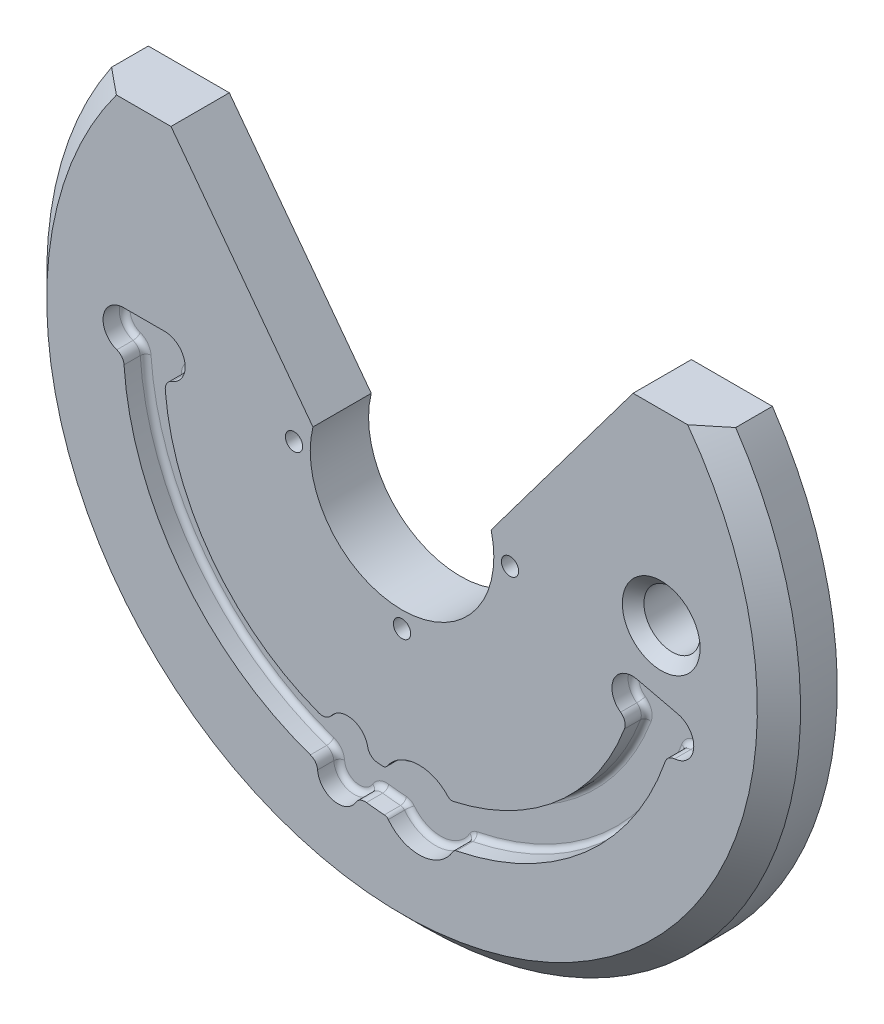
ISO-10303-21;
HEADER;
FILE_DESCRIPTION(('STEP AP214'),'2;1');
FILE_NAME('part.step','',(''),(''),'','','');
FILE_SCHEMA(('AUTOMOTIVE_DESIGN { 1 0 10303 214 1 1 1 1 }'));
ENDSEC;
DATA;
#1=APPLICATION_CONTEXT('core data for automotive mechanical design processes');
#2=APPLICATION_PROTOCOL_DEFINITION('international standard','automotive_design',2000,#1);
#3=PRODUCT_CONTEXT('',#1,'mechanical');
#4=PRODUCT('Part','Part','',(#3));
#5=PRODUCT_RELATED_PRODUCT_CATEGORY('part','',(#4));
#6=PRODUCT_DEFINITION_FORMATION('','',#4);
#7=PRODUCT_DEFINITION_CONTEXT('part definition',#1,'design');
#8=PRODUCT_DEFINITION('design','',#6,#7);
#9=PRODUCT_DEFINITION_SHAPE('','',#8);
#10=(LENGTH_UNIT() NAMED_UNIT(*) SI_UNIT(.MILLI.,.METRE.));
#11=(NAMED_UNIT(*) PLANE_ANGLE_UNIT() SI_UNIT($,.RADIAN.));
#12=(NAMED_UNIT(*) SI_UNIT($,.STERADIAN.) SOLID_ANGLE_UNIT());
#13=UNCERTAINTY_MEASURE_WITH_UNIT(LENGTH_MEASURE(1.E-05),#10,'distance_accuracy_value','');
#14=(GEOMETRIC_REPRESENTATION_CONTEXT(3) GLOBAL_UNCERTAINTY_ASSIGNED_CONTEXT((#13)) GLOBAL_UNIT_ASSIGNED_CONTEXT((#10,
#11,#12)) REPRESENTATION_CONTEXT('',''));
#15=CARTESIAN_POINT('',(0.,0.,0.));
#16=DIRECTION('',(0.,0.,1.));
#17=DIRECTION('',(1.,0.,0.));
#18=AXIS2_PLACEMENT_3D('',#15,#16,#17);
#19=CARTESIAN_POINT('',(0.,0.,5.4));
#20=DIRECTION('',(0.,0.,1.));
#21=DIRECTION('',(1.,0.,0.));
#22=AXIS2_PLACEMENT_3D('',#19,#20,#21);
#23=PLANE('',#22);
#24=CARTESIAN_POINT('',(23.9971351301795,2.22800969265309,5.4));
#25=DIRECTION('',(0.,0.,1.));
#26=DIRECTION('',(1.,0.,0.));
#27=AXIS2_PLACEMENT_3D('',#24,#25,#26);
#28=CIRCLE('',#27,3.6);
#29=CARTESIAN_POINT('',(27.5971351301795,2.22800969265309,5.4));
#30=VERTEX_POINT('',#29);
#31=EDGE_CURVE('E660',#30,#30,#28,.F.);
#32=ORIENTED_EDGE('',*,*,#31,.T.);
#33=EDGE_LOOP('',(#32));
#34=FACE_BOUND('',#33,.T.);
#35=DIRECTION('',(-1.,0.,0.));
#36=VECTOR('',#35,1.);
#37=CARTESIAN_POINT('',(0.,19.5750825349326,5.4));
#38=LINE('',#37,#36);
#39=CARTESIAN_POINT('',(-21.3933581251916,19.5750825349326,5.4));
#40=VERTEX_POINT('',#39);
#41=CARTESIAN_POINT('',(-26.4428845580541,19.5750825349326,5.4));
#42=VERTEX_POINT('',#41);
#43=EDGE_CURVE('E523',#40,#42,#38,.T.);
#44=ORIENTED_EDGE('',*,*,#43,.T.);
#45=CARTESIAN_POINT('',(0.,0.,5.4));
#46=DIRECTION('',(0.,0.,1.));
#47=DIRECTION('',(1.,0.,0.));
#48=AXIS2_PLACEMENT_3D('',#45,#46,#47);
#49=CIRCLE('',#48,32.9);
#50=CARTESIAN_POINT('',(26.4428845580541,19.5750825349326,5.4));
#51=VERTEX_POINT('',#50);
#52=EDGE_CURVE('E867',#42,#51,#49,.T.);
#53=ORIENTED_EDGE('',*,*,#52,.T.);
#54=DIRECTION('',(-1.,0.,0.));
#55=VECTOR('',#54,1.);
#56=CARTESIAN_POINT('',(0.,19.5750825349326,5.4));
#57=LINE('',#56,#55);
#58=CARTESIAN_POINT('',(21.3933581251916,19.5750825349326,5.4));
#59=VERTEX_POINT('',#58);
#60=EDGE_CURVE('E526',#51,#59,#57,.T.);
#61=ORIENTED_EDGE('',*,*,#60,.T.);
#62=DIRECTION('',(-0.599906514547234,-0.800070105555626,0.));
#63=VECTOR('',#62,1.);
#64=CARTESIAN_POINT('',(4.29875008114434,-3.22327776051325,5.4));
#65=LINE('',#64,#63);
#66=CARTESIAN_POINT('',(8.25,2.04633819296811,5.4));
#67=VERTEX_POINT('',#66);
#68=EDGE_CURVE('E520',#59,#67,#65,.T.);
#69=ORIENTED_EDGE('',*,*,#68,.T.);
#70=CARTESIAN_POINT('',(0.,0.,5.4));
#71=DIRECTION('',(0.,0.,1.));
#72=DIRECTION('',(1.,0.,0.));
#73=AXIS2_PLACEMENT_3D('',#70,#71,#72);
#74=CIRCLE('',#73,8.5);
#75=CARTESIAN_POINT('',(-8.25,2.04633819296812,5.4));
#76=VERTEX_POINT('',#75);
#77=EDGE_CURVE('E529',#76,#67,#74,.T.);
#78=ORIENTED_EDGE('',*,*,#77,.F.);
#79=DIRECTION('',(-0.599906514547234,0.800070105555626,0.));
#80=VECTOR('',#79,1.);
#81=CARTESIAN_POINT('',(-4.29875008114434,-3.22327776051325,5.4));
#82=LINE('',#81,#80);
#83=EDGE_CURVE('E517',#76,#40,#82,.T.);
#84=ORIENTED_EDGE('',*,*,#83,.T.);
#85=EDGE_LOOP('',(#44,#53,#61,#69,#78,#84));
#86=FACE_BOUND('',#85,.T.);
#87=CARTESIAN_POINT('',(19.6541068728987,-7.39703204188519,5.4));
#88=DIRECTION('',(0.,0.,-1.));
#89=DIRECTION('',(1.,0.,0.));
#90=AXIS2_PLACEMENT_3D('',#87,#88,#89);
#91=CIRCLE('',#90,0.999999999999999);
#92=CARTESIAN_POINT('',(20.2328119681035,-6.58149515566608,5.4));
#93=VERTEX_POINT('',#92);
#94=CARTESIAN_POINT('',(20.5900167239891,-7.74927166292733,5.4));
#95=VERTEX_POINT('',#94);
#96=EDGE_CURVE('E367',#93,#95,#91,.T.);
#97=ORIENTED_EDGE('',*,*,#96,.F.);
#98=CARTESIAN_POINT('',(21.3323516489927,-5.03197507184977,5.4));
#99=DIRECTION('',(0.,0.,1.));
#100=DIRECTION('',(1.,0.,0.));
#101=AXIS2_PLACEMENT_3D('',#98,#99,#100);
#102=CIRCLE('',#101,1.9);
#103=CARTESIAN_POINT('',(21.7685611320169,-3.18272622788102,5.4));
#104=VERTEX_POINT('',#103);
#105=EDGE_CURVE('E446',#104,#93,#102,.T.);
#106=ORIENTED_EDGE('',*,*,#105,.F.);
#107=DIRECTION('',(-0.973288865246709,0.229583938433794,0.));
#108=VECTOR('',#107,1.);
#109=CARTESIAN_POINT('',(21.7685611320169,-3.18272622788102,5.4));
#110=LINE('',#109,#108);
#111=CARTESIAN_POINT('',(25.5470622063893,-4.07401676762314,5.4));
#112=VERTEX_POINT('',#111);
#113=EDGE_CURVE('E443',#112,#104,#110,.T.);
#114=ORIENTED_EDGE('',*,*,#113,.F.);
#115=CARTESIAN_POINT('',(25.1108527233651,-5.92326561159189,5.4));
#116=DIRECTION('',(0.,0.,1.));
#117=DIRECTION('',(1.,0.,0.));
#118=AXIS2_PLACEMENT_3D('',#115,#116,#117);
#119=CIRCLE('',#118,1.9);
#120=CARTESIAN_POINT('',(25.2401967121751,-7.81885790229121,5.4));
#121=VERTEX_POINT('',#120);
#122=EDGE_CURVE('E440',#121,#112,#119,.T.);
#123=ORIENTED_EDGE('',*,*,#122,.F.);
#124=CARTESIAN_POINT('',(25.3082724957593,-8.81653805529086,5.4));
#125=DIRECTION('',(0.,0.,-1.));
#126=DIRECTION('',(-1.,0.,0.));
#127=AXIS2_PLACEMENT_3D('',#124,#125,#126);
#128=CIRCLE('',#127,1.);
#129=CARTESIAN_POINT('',(24.3639339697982,-8.48756275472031,5.4));
#130=VERTEX_POINT('',#129);
#131=EDGE_CURVE('E437',#130,#121,#128,.T.);
#132=ORIENTED_EDGE('',*,*,#131,.F.);
#133=CARTESIAN_POINT('',(0.,0.,5.4));
#134=DIRECTION('',(0.,0.,1.));
#135=DIRECTION('',(1.,0.,0.));
#136=AXIS2_PLACEMENT_3D('',#133,#134,#135);
#137=CIRCLE('',#136,25.8);
#138=CARTESIAN_POINT('',(5.03775262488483,-25.3033801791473,5.4));
#139=VERTEX_POINT('',#138);
#140=EDGE_CURVE('E434',#139,#130,#137,.T.);
#141=ORIENTED_EDGE('',*,*,#140,.F.);
#142=CARTESIAN_POINT('',(5.13538348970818,-25.7937557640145,5.4));
#143=DIRECTION('',(0.,0.,-1.));
#144=DIRECTION('',(1.,0.,0.));
#145=AXIS2_PLACEMENT_3D('',#142,#143,#144);
#146=CIRCLE('',#145,0.500000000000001);
#147=CARTESIAN_POINT('',(4.70211998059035,-25.5441906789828,5.4));
#148=VERTEX_POINT('',#147);
#149=EDGE_CURVE('E431',#148,#139,#146,.T.);
#150=ORIENTED_EDGE('',*,*,#149,.F.);
#151=CARTESIAN_POINT('',(1.582622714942,-23.7473220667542,5.4));
#152=DIRECTION('',(0.,0.,1.));
#153=DIRECTION('',(1.,0.,0.));
#154=AXIS2_PLACEMENT_3D('',#151,#152,#153);
#155=CIRCLE('',#154,3.59999999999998);
#156=CARTESIAN_POINT('',(-1.27084392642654,-25.9422544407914,5.4));
#157=VERTEX_POINT('',#156);
#158=EDGE_CURVE('E428',#157,#148,#155,.T.);
#159=ORIENTED_EDGE('',*,*,#158,.F.);
#160=CARTESIAN_POINT('',(-1.66715873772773,-26.2471061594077,5.4));
#161=DIRECTION('',(0.,0.,-1.));
#162=DIRECTION('',(-1.,0.,0.));
#163=AXIS2_PLACEMENT_3D('',#160,#161,#162);
#164=CIRCLE('',#163,0.5);
#165=CARTESIAN_POINT('',(-1.63546370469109,-25.7481117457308,5.4));
#166=VERTEX_POINT('',#165);
#167=EDGE_CURVE('E425',#166,#157,#164,.T.);
#168=ORIENTED_EDGE('',*,*,#167,.F.);
#169=CARTESIAN_POINT('',(0.,0.,5.4));
#170=DIRECTION('',(0.,0.,1.));
#171=DIRECTION('',(1.,0.,0.));
#172=AXIS2_PLACEMENT_3D('',#169,#170,#171);
#173=CIRCLE('',#172,25.8);
#174=CARTESIAN_POINT('',(-3.29550148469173,-25.588662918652,5.4));
#175=VERTEX_POINT('',#174);
#176=EDGE_CURVE('E422',#175,#166,#173,.T.);
#177=ORIENTED_EDGE('',*,*,#176,.F.);
#178=CARTESIAN_POINT('',(-3.42323410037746,-26.5804715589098,5.4));
#179=DIRECTION('',(0.,0.,-1.));
#180=DIRECTION('',(1.,0.,0.));
#181=AXIS2_PLACEMENT_3D('',#178,#179,#180);
#182=CIRCLE('',#181,1.);
#183=CARTESIAN_POINT('',(-4.28531102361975,-26.0736941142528,5.4));
#184=VERTEX_POINT('',#183);
#185=EDGE_CURVE('E419',#184,#175,#182,.T.);
#186=ORIENTED_EDGE('',*,*,#185,.F.);
#187=CARTESIAN_POINT('',(-5.92325717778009,-25.1108169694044,5.4));
#188=DIRECTION('',(0.,0.,1.));
#189=DIRECTION('',(1.,0.,0.));
#190=AXIS2_PLACEMENT_3D('',#187,#188,#189);
#191=CIRCLE('',#190,1.9);
#192=CARTESIAN_POINT('',(-7.81884769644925,-25.2401869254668,5.4));
#193=VERTEX_POINT('',#192);
#194=EDGE_CURVE('E416',#193,#184,#191,.T.);
#195=ORIENTED_EDGE('',*,*,#194,.F.);
#196=CARTESIAN_POINT('',(-8.81652691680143,-25.308276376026,5.4));
#197=DIRECTION('',(0.,0.,-1.));
#198=DIRECTION('',(-1.,0.,0.));
#199=AXIS2_PLACEMENT_3D('',#196,#197,#198);
#200=CIRCLE('',#199,0.999999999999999);
#201=CARTESIAN_POINT('',(-8.48755203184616,-24.3639377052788,5.4));
#202=VERTEX_POINT('',#201);
#203=EDGE_CURVE('E413',#202,#193,#200,.T.);
#204=ORIENTED_EDGE('',*,*,#203,.F.);
#205=CARTESIAN_POINT('',(0.,0.,5.4));
#206=DIRECTION('',(0.,0.,1.));
#207=DIRECTION('',(1.,0.,0.));
#208=AXIS2_PLACEMENT_3D('',#205,#206,#207);
#209=CIRCLE('',#208,25.8);
#210=CARTESIAN_POINT('',(-25.7425651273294,-1.72056405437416,5.4));
#211=VERTEX_POINT('',#210);
#212=EDGE_CURVE('E410',#211,#202,#209,.T.);
#213=ORIENTED_EDGE('',*,*,#212,.F.);
#214=CARTESIAN_POINT('',(-26.7403389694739,-1.78725258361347,5.4));
#215=DIRECTION('',(0.,0.,-1.));
#216=DIRECTION('',(-1.,0.,0.));
#217=AXIS2_PLACEMENT_3D('',#214,#215,#216);
#218=CIRCLE('',#217,1.);
#219=CARTESIAN_POINT('',(-26.4100509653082,-0.843372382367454,5.4));
#220=VERTEX_POINT('',#219);
#221=EDGE_CURVE('E407',#220,#211,#218,.T.);
#222=ORIENTED_EDGE('',*,*,#221,.F.);
#223=CARTESIAN_POINT('',(-25.7825037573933,0.94999999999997,5.4));
#224=DIRECTION('',(0.,0.,1.));
#225=DIRECTION('',(1.,0.,0.));
#226=AXIS2_PLACEMENT_3D('',#223,#224,#225);
#227=CIRCLE('',#226,1.9);
#228=CARTESIAN_POINT('',(-25.7825037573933,2.84999999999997,5.4));
#229=VERTEX_POINT('',#228);
#230=EDGE_CURVE('E404',#229,#220,#227,.T.);
#231=ORIENTED_EDGE('',*,*,#230,.F.);
#232=DIRECTION('',(-1.,0.,0.));
#233=VECTOR('',#232,1.);
#234=CARTESIAN_POINT('',(-25.7825037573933,2.84999999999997,5.4));
#235=LINE('',#234,#233);
#236=CARTESIAN_POINT('',(-21.9794790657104,2.84999999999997,5.4));
#237=VERTEX_POINT('',#236);
#238=EDGE_CURVE('E401',#237,#229,#235,.T.);
#239=ORIENTED_EDGE('',*,*,#238,.F.);
#240=CARTESIAN_POINT('',(-21.9794790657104,0.94999999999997,5.4));
#241=DIRECTION('',(0.,0.,1.));
#242=DIRECTION('',(1.,0.,0.));
#243=AXIS2_PLACEMENT_3D('',#240,#241,#242);
#244=CIRCLE('',#243,1.9);
#245=CARTESIAN_POINT('',(-21.2897753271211,-0.820397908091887,5.4));
#246=VERTEX_POINT('',#245);
#247=EDGE_CURVE('E398',#246,#237,#244,.T.);
#248=ORIENTED_EDGE('',*,*,#247,.F.);
#249=CARTESIAN_POINT('',(-20.9267733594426,-1.75218628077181,5.4));
#250=DIRECTION('',(0.,0.,-1.));
#251=DIRECTION('',(1.,0.,0.));
#252=AXIS2_PLACEMENT_3D('',#249,#250,#251);
#253=CIRCLE('',#252,1.);
#254=CARTESIAN_POINT('',(-21.9232863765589,-1.83562372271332,5.4));
#255=VERTEX_POINT('',#254);
#256=EDGE_CURVE('E395',#255,#246,#253,.T.);
#257=ORIENTED_EDGE('',*,*,#256,.F.);
#258=CARTESIAN_POINT('',(0.,0.,5.4));
#259=DIRECTION('',(0.,0.,-1.));
#260=DIRECTION('',(1.,0.,0.));
#261=AXIS2_PLACEMENT_3D('',#258,#259,#260);
#262=CIRCLE('',#261,22.);
#263=CARTESIAN_POINT('',(-7.71666740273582,-20.6022582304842,5.4));
#264=VERTEX_POINT('',#263);
#265=EDGE_CURVE('E392',#264,#255,#262,.T.);
#266=ORIENTED_EDGE('',*,*,#265,.F.);
#267=CARTESIAN_POINT('',(-7.36590979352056,-19.6657919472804,5.4));
#268=DIRECTION('',(0.,0.,-1.));
#269=DIRECTION('',(-1.,0.,0.));
#270=AXIS2_PLACEMENT_3D('',#267,#268,#269);
#271=CIRCLE('',#270,0.999999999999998);
#272=CARTESIAN_POINT('',(-6.56761215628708,-20.2680550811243,5.4));
#273=VERTEX_POINT('',#272);
#274=EDGE_CURVE('E389',#273,#264,#271,.T.);
#275=ORIENTED_EDGE('',*,*,#274,.F.);
#276=CARTESIAN_POINT('',(-5.05084664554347,-21.4123550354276,5.4));
#277=DIRECTION('',(0.,0.,1.));
#278=DIRECTION('',(1.,0.,0.));
#279=AXIS2_PLACEMENT_3D('',#276,#277,#278);
#280=CIRCLE('',#279,1.9);
#281=CARTESIAN_POINT('',(-3.18258380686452,-21.0665314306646,5.4));
#282=VERTEX_POINT('',#281);
#283=EDGE_CURVE('E386',#282,#273,#280,.T.);
#284=ORIENTED_EDGE('',*,*,#283,.F.);
#285=CARTESIAN_POINT('',(-2.19928757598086,-20.8845190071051,5.4));
#286=DIRECTION('',(0.,0.,-1.));
#287=DIRECTION('',(1.,0.,0.));
#288=AXIS2_PLACEMENT_3D('',#285,#286,#287);
#289=CIRCLE('',#288,0.999999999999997);
#290=CARTESIAN_POINT('',(-2.30401555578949,-21.8790199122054,5.4));
#291=VERTEX_POINT('',#290);
#292=EDGE_CURVE('E383',#291,#282,#289,.T.);
#293=ORIENTED_EDGE('',*,*,#292,.F.);
#294=CARTESIAN_POINT('',(0.,0.,5.4));
#295=DIRECTION('',(0.,0.,-1.));
#296=DIRECTION('',(1.,0.,0.));
#297=AXIS2_PLACEMENT_3D('',#294,#295,#296);
#298=CIRCLE('',#297,22.);
#299=CARTESIAN_POINT('',(-1.83791810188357,-21.9230941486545,5.4));
#300=VERTEX_POINT('',#299);
#301=EDGE_CURVE('E380',#300,#291,#298,.T.);
#302=ORIENTED_EDGE('',*,*,#301,.F.);
#303=CARTESIAN_POINT('',(-1.79614723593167,-21.4248420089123,5.4));
#304=DIRECTION('',(0.,0.,-1.));
#305=DIRECTION('',(1.,0.,0.));
#306=AXIS2_PLACEMENT_3D('',#303,#304,#305);
#307=CIRCLE('',#306,0.499999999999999);
#308=CARTESIAN_POINT('',(-1.38410211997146,-21.7080712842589,5.4));
#309=VERTEX_POINT('',#308);
#310=EDGE_CURVE('E374',#309,#300,#307,.T.);
#311=ORIENTED_EDGE('',*,*,#310,.F.);
#312=CARTESIAN_POINT('',(1.582622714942,-23.7473220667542,5.4));
#313=DIRECTION('',(0.,0.,1.));
#314=DIRECTION('',(1.,0.,0.));
#315=AXIS2_PLACEMENT_3D('',#312,#313,#314);
#316=CIRCLE('',#315,3.59999999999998);
#317=CARTESIAN_POINT('',(4.25250408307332,-21.3324238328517,5.4));
#318=VERTEX_POINT('',#317);
#319=EDGE_CURVE('E372',#318,#309,#316,.T.);
#320=ORIENTED_EDGE('',*,*,#319,.F.);
#321=CARTESIAN_POINT('',(4.62332093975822,-20.9970213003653,5.4));
#322=DIRECTION('',(0.,0.,-1.));
#323=DIRECTION('',(-1.,0.,0.));
#324=AXIS2_PLACEMENT_3D('',#321,#322,#323);
#325=CIRCLE('',#324,0.5);
#326=CARTESIAN_POINT('',(4.7308400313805,-21.485324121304,5.4));
#327=VERTEX_POINT('',#326);
#328=EDGE_CURVE('E351',#327,#318,#325,.T.);
#329=ORIENTED_EDGE('',*,*,#328,.F.);
#330=CARTESIAN_POINT('',(0.,0.,5.4));
#331=DIRECTION('',(0.,0.,-1.));
#332=DIRECTION('',(1.,0.,0.));
#333=AXIS2_PLACEMENT_3D('',#330,#331,#332);
#334=CIRCLE('',#333,22.);
#335=EDGE_CURVE('E361',#95,#327,#334,.T.);
#336=ORIENTED_EDGE('',*,*,#335,.F.);
#337=EDGE_LOOP('',(#97,#106,#114,#123,#132,#141,#150,#159,#168,#177,#186,#195,#204,#213,#222,
#231,#239,#248,#257,#266,#275,#284,#293,#302,#311,#320,#329,#336));
#338=FACE_BOUND('',#337,.T.);
#339=CARTESIAN_POINT('',(-10.,0.,5.4));
#340=DIRECTION('',(0.,0.,1.));
#341=DIRECTION('',(1.,0.,0.));
#342=AXIS2_PLACEMENT_3D('',#339,#340,#341);
#343=CIRCLE('',#342,0.800000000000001);
#344=CARTESIAN_POINT('',(-9.2,0.,5.4));
#345=VERTEX_POINT('',#344);
#346=EDGE_CURVE('E746',#345,#345,#343,.T.);
#347=ORIENTED_EDGE('',*,*,#346,.F.);
#348=EDGE_LOOP('',(#347));
#349=FACE_BOUND('',#348,.T.);
#350=CARTESIAN_POINT('',(0.,-10.,5.4));
#351=DIRECTION('',(0.,0.,1.));
#352=DIRECTION('',(1.,0.,0.));
#353=AXIS2_PLACEMENT_3D('',#350,#351,#352);
#354=CIRCLE('',#353,0.8);
#355=CARTESIAN_POINT('',(0.8,-10.,5.4));
#356=VERTEX_POINT('',#355);
#357=EDGE_CURVE('E750',#356,#356,#354,.T.);
#358=ORIENTED_EDGE('',*,*,#357,.F.);
#359=EDGE_LOOP('',(#358));
#360=FACE_BOUND('',#359,.T.);
#361=CARTESIAN_POINT('',(10.,0.,5.4));
#362=DIRECTION('',(0.,0.,1.));
#363=DIRECTION('',(1.,0.,0.));
#364=AXIS2_PLACEMENT_3D('',#361,#362,#363);
#365=CIRCLE('',#364,0.800000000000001);
#366=CARTESIAN_POINT('',(10.8,0.,5.4));
#367=VERTEX_POINT('',#366);
#368=EDGE_CURVE('E754',#367,#367,#365,.T.);
#369=ORIENTED_EDGE('',*,*,#368,.F.);
#370=EDGE_LOOP('',(#369));
#371=FACE_BOUND('',#370,.T.);
#372=ADVANCED_FACE('F31',(#34,#86,#338,#349,#360,#371),#23,.T.);
#373=CARTESIAN_POINT('',(0.,0.,0.));
#374=DIRECTION('',(0.,0.,1.));
#375=DIRECTION('',(1.,0.,0.));
#376=AXIS2_PLACEMENT_3D('',#373,#374,#375);
#377=PLANE('',#376);
#378=DIRECTION('',(0.599906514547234,0.800070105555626,0.));
#379=VECTOR('',#378,1.);
#380=CARTESIAN_POINT('',(8.25,2.04633819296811,0.));
#381=LINE('',#380,#379);
#382=CARTESIAN_POINT('',(8.25,2.04633819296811,0.));
#383=VERTEX_POINT('',#382);
#384=CARTESIAN_POINT('',(21.3933581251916,19.5750825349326,0.));
#385=VERTEX_POINT('',#384);
#386=EDGE_CURVE('E451',#383,#385,#381,.T.);
#387=ORIENTED_EDGE('',*,*,#386,.T.);
#388=DIRECTION('',(1.,0.,0.));
#389=VECTOR('',#388,1.);
#390=CARTESIAN_POINT('',(30.9181208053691,19.5750825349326,0.));
#391=LINE('',#390,#389);
#392=CARTESIAN_POINT('',(28.8933581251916,19.5750825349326,0.));
#393=VERTEX_POINT('',#392);
#394=EDGE_CURVE('E504',#385,#393,#391,.T.);
#395=ORIENTED_EDGE('',*,*,#394,.T.);
#396=CARTESIAN_POINT('',(0.,0.,0.));
#397=DIRECTION('',(0.,0.,1.));
#398=DIRECTION('',(1.,0.,0.));
#399=AXIS2_PLACEMENT_3D('',#396,#397,#398);
#400=CIRCLE('',#399,34.9);
#401=CARTESIAN_POINT('',(-28.8933581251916,19.5750825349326,0.));
#402=VERTEX_POINT('',#401);
#403=EDGE_CURVE('E532',#402,#393,#400,.T.);
#404=ORIENTED_EDGE('',*,*,#403,.F.);
#405=DIRECTION('',(1.,0.,0.));
#406=VECTOR('',#405,1.);
#407=CARTESIAN_POINT('',(-30.9181208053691,19.5750825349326,0.));
#408=LINE('',#407,#406);
#409=CARTESIAN_POINT('',(-21.3933581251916,19.5750825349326,0.));
#410=VERTEX_POINT('',#409);
#411=EDGE_CURVE('E507',#402,#410,#408,.T.);
#412=ORIENTED_EDGE('',*,*,#411,.T.);
#413=DIRECTION('',(0.599906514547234,-0.800070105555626,0.));
#414=VECTOR('',#413,1.);
#415=CARTESIAN_POINT('',(-8.25,2.04633819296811,0.));
#416=LINE('',#415,#414);
#417=CARTESIAN_POINT('',(-8.25,2.04633819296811,0.));
#418=VERTEX_POINT('',#417);
#419=EDGE_CURVE('E510',#410,#418,#416,.T.);
#420=ORIENTED_EDGE('',*,*,#419,.T.);
#421=CARTESIAN_POINT('',(0.,0.,0.));
#422=DIRECTION('',(0.,0.,1.));
#423=DIRECTION('',(1.,0.,0.));
#424=AXIS2_PLACEMENT_3D('',#421,#422,#423);
#425=CIRCLE('',#424,8.5);
#426=EDGE_CURVE('E528',#418,#383,#425,.T.);
#427=ORIENTED_EDGE('',*,*,#426,.T.);
#428=EDGE_LOOP('',(#387,#395,#404,#412,#420,#427));
#429=FACE_BOUND('',#428,.T.);
#430=CARTESIAN_POINT('',(-10.,0.,0.));
#431=DIRECTION('',(0.,0.,1.));
#432=DIRECTION('',(1.,0.,0.));
#433=AXIS2_PLACEMENT_3D('',#430,#431,#432);
#434=CIRCLE('',#433,0.800000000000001);
#435=CARTESIAN_POINT('',(-9.2,0.,0.));
#436=VERTEX_POINT('',#435);
#437=EDGE_CURVE('E664',#436,#436,#434,.T.);
#438=ORIENTED_EDGE('',*,*,#437,.T.);
#439=EDGE_LOOP('',(#438));
#440=FACE_BOUND('',#439,.T.);
#441=CARTESIAN_POINT('',(0.,-10.,0.));
#442=DIRECTION('',(0.,0.,1.));
#443=DIRECTION('',(1.,0.,0.));
#444=AXIS2_PLACEMENT_3D('',#441,#442,#443);
#445=CIRCLE('',#444,0.8);
#446=CARTESIAN_POINT('',(0.8,-10.,0.));
#447=VERTEX_POINT('',#446);
#448=EDGE_CURVE('E747',#447,#447,#445,.T.);
#449=ORIENTED_EDGE('',*,*,#448,.T.);
#450=EDGE_LOOP('',(#449));
#451=FACE_BOUND('',#450,.T.);
#452=CARTESIAN_POINT('',(10.,0.,0.));
#453=DIRECTION('',(0.,0.,1.));
#454=DIRECTION('',(1.,0.,0.));
#455=AXIS2_PLACEMENT_3D('',#452,#453,#454);
#456=CIRCLE('',#455,0.800000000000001);
#457=CARTESIAN_POINT('',(10.8,0.,0.));
#458=VERTEX_POINT('',#457);
#459=EDGE_CURVE('E751',#458,#458,#456,.T.);
#460=ORIENTED_EDGE('',*,*,#459,.T.);
#461=EDGE_LOOP('',(#460));
#462=FACE_BOUND('',#461,.T.);
#463=CARTESIAN_POINT('',(23.9971351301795,2.22800969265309,0.));
#464=DIRECTION('',(0.,0.,1.));
#465=DIRECTION('',(1.,0.,0.));
#466=AXIS2_PLACEMENT_3D('',#463,#464,#465);
#467=CIRCLE('',#466,2.6);
#468=CARTESIAN_POINT('',(26.5971351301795,2.22800969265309,0.));
#469=VERTEX_POINT('',#468);
#470=EDGE_CURVE('E1104',#469,#469,#467,.T.);
#471=ORIENTED_EDGE('',*,*,#470,.T.);
#472=EDGE_LOOP('',(#471));
#473=FACE_BOUND('',#472,.T.);
#474=ADVANCED_FACE('F835',(#429,#440,#451,#462,#473),#377,.F.);
#475=CARTESIAN_POINT('',(1.582622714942,-23.7473220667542,3.4));
#476=DIRECTION('',(0.,0.,1.));
#477=DIRECTION('',(1.,0.,0.));
#478=AXIS2_PLACEMENT_3D('',#475,#476,#477);
#479=CYLINDRICAL_SURFACE('',#478,3.59999999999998);
#480=DIRECTION('',(0.,0.,1.));
#481=VECTOR('',#480,1.);
#482=CARTESIAN_POINT('',(-1.38410211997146,-21.7080712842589,3.4));
#483=LINE('',#482,#481);
#484=CARTESIAN_POINT('',(-1.38410211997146,-21.7080712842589,3.9));
#485=VERTEX_POINT('',#484);
#486=EDGE_CURVE('E498',#485,#309,#483,.T.);
#487=ORIENTED_EDGE('',*,*,#486,.F.);
#488=CARTESIAN_POINT('',(1.582622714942,-23.7473220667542,3.9));
#489=DIRECTION('',(0.,0.,1.));
#490=DIRECTION('',(1.,0.,0.));
#491=AXIS2_PLACEMENT_3D('',#488,#489,#490);
#492=CIRCLE('',#491,3.59999999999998);
#493=CARTESIAN_POINT('',(4.25250408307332,-21.3324238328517,3.9));
#494=VERTEX_POINT('',#493);
#495=EDGE_CURVE('E653',#485,#494,#492,.F.);
#496=ORIENTED_EDGE('',*,*,#495,.T.);
#497=DIRECTION('',(0.,0.,1.));
#498=VECTOR('',#497,1.);
#499=CARTESIAN_POINT('',(4.25250408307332,-21.3324238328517,3.4));
#500=LINE('',#499,#498);
#501=EDGE_CURVE('E357',#494,#318,#500,.T.);
#502=ORIENTED_EDGE('',*,*,#501,.T.);
#503=ORIENTED_EDGE('',*,*,#319,.T.);
#504=EDGE_LOOP('',(#487,#496,#502,#503));
#505=FACE_BOUND('',#504,.T.);
#506=CARTESIAN_POINT('',(0.,-20.5138556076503,3.95428335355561));
#507=CARTESIAN_POINT('',(0.0300232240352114,-20.4991619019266,3.95010832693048));
#508=CARTESIAN_POINT('',(0.0605645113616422,-20.4847351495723,3.94835399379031));
#509=CARTESIAN_POINT('',(0.121962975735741,-20.4567880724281,3.95023070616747));
#510=CARTESIAN_POINT('',(0.152820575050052,-20.4432692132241,3.95387025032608));
#511=CARTESIAN_POINT('',(0.214038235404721,-20.4174445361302,3.96695736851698));
#512=CARTESIAN_POINT('',(0.24439476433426,-20.4051455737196,3.97643582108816));
#513=CARTESIAN_POINT('',(0.303241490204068,-20.3821800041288,4.00129001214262));
#514=CARTESIAN_POINT('',(0.331733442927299,-20.3715118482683,4.01666010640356));
#515=CARTESIAN_POINT('',(0.383167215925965,-20.3529168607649,4.051249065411));
#516=CARTESIAN_POINT('',(0.40637858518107,-20.344827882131,4.06998167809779));
#517=CARTESIAN_POINT('',(0.44949316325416,-20.3302273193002,4.11144132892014));
#518=CARTESIAN_POINT('',(0.469396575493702,-20.3237156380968,4.13416812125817));
#519=CARTESIAN_POINT('',(0.50464250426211,-20.3124581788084,4.1819867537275));
#520=CARTESIAN_POINT('',(0.520122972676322,-20.3076574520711,4.2069645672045));
#521=CARTESIAN_POINT('',(0.547103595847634,-20.2994387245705,4.25918735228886));
#522=CARTESIAN_POINT('',(0.558603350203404,-20.2960208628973,4.28643255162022));
#523=CARTESIAN_POINT('',(0.577887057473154,-20.2903562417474,4.343748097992));
#524=CARTESIAN_POINT('',(0.585473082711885,-20.2881714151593,4.37389092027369));
#525=CARTESIAN_POINT('',(0.596060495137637,-20.2851370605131,4.43503296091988));
#526=CARTESIAN_POINT('',(0.599060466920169,-20.2842879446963,4.46603244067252));
#527=CARTESIAN_POINT('',(0.600620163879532,-20.2838451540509,4.53055758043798));
#528=CARTESIAN_POINT('',(0.598817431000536,-20.2843539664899,4.56409267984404));
#529=CARTESIAN_POINT('',(0.590222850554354,-20.2868074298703,4.63046014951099));
#530=CARTESIAN_POINT('',(0.583429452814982,-20.2887525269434,4.66329229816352));
#531=CARTESIAN_POINT('',(0.56449460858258,-20.2942771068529,4.72994322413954));
#532=CARTESIAN_POINT('',(0.551987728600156,-20.2979690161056,4.76364899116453));
#533=CARTESIAN_POINT('',(0.522109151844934,-20.3070381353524,4.82858285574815));
#534=CARTESIAN_POINT('',(0.504736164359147,-20.3124157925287,4.85981029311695));
#535=CARTESIAN_POINT('',(0.464519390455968,-20.3252880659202,4.92095386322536));
#536=CARTESIAN_POINT('',(0.441401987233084,-20.332893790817,4.95066675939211));
#537=CARTESIAN_POINT('',(0.391189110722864,-20.3500894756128,5.00585115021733));
#538=CARTESIAN_POINT('',(0.364092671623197,-20.3596799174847,5.03132161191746));
#539=CARTESIAN_POINT('',(0.305337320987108,-20.3813794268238,5.07867652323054));
#540=CARTESIAN_POINT('',(0.273516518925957,-20.3935917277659,5.10031292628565));
#541=CARTESIAN_POINT('',(0.207482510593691,-20.4201227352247,5.1378915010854));
#542=CARTESIAN_POINT('',(0.17326883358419,-20.4344418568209,5.15383254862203));
#543=CARTESIAN_POINT('',(0.10207002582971,-20.4656255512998,5.18023849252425));
#544=CARTESIAN_POINT('',(0.0650287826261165,-20.4825688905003,5.19045951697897));
#545=CARTESIAN_POINT('',(-0.00945902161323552,-20.5182383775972,5.20418999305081));
#546=CARTESIAN_POINT('',(-0.0469057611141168,-20.5369653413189,5.20769635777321));
#547=CARTESIAN_POINT('',(-0.121679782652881,-20.5760198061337,5.20780459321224));
#548=CARTESIAN_POINT('',(-0.158997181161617,-20.5963668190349,5.2043040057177));
#549=CARTESIAN_POINT('',(-0.23181891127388,-20.6377320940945,5.18997928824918));
#550=CARTESIAN_POINT('',(-0.267324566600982,-20.6587498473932,5.17916058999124));
#551=CARTESIAN_POINT('',(-0.328300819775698,-20.6961943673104,5.1529947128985));
#552=CARTESIAN_POINT('',(-0.354334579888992,-20.7126773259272,5.13903428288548));
#553=CARTESIAN_POINT('',(-0.40375447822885,-20.7447947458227,5.10628516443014));
#554=CARTESIAN_POINT('',(-0.427143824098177,-20.7604302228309,5.08750241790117));
#555=CARTESIAN_POINT('',(-0.467203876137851,-20.7878101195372,5.04835116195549));
#556=CARTESIAN_POINT('',(-0.484356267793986,-20.7997868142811,5.02863935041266));
#557=CARTESIAN_POINT('',(-0.515576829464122,-20.8219289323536,4.98600704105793));
#558=CARTESIAN_POINT('',(-0.529646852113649,-20.8320954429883,4.96308848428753));
#559=CARTESIAN_POINT('',(-0.554231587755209,-20.8500667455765,4.91441639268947));
#560=CARTESIAN_POINT('',(-0.564730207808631,-20.8578608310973,4.88865070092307));
#561=CARTESIAN_POINT('',(-0.581712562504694,-20.8705588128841,4.83516048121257));
#562=CARTESIAN_POINT('',(-0.588197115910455,-20.8754632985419,4.80743635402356));
#563=CARTESIAN_POINT('',(-0.596740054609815,-20.8819418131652,4.75312905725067));
#564=CARTESIAN_POINT('',(-0.599095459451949,-20.8837391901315,4.72661760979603));
#565=CARTESIAN_POINT('',(-0.600473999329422,-20.8847901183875,4.67346914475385));
#566=CARTESIAN_POINT('',(-0.599496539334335,-20.884043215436,4.6468321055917));
#567=CARTESIAN_POINT('',(-0.594326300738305,-20.8801102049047,4.59216323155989));
#568=CARTESIAN_POINT('',(-0.589911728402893,-20.8767558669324,4.56416543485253));
#569=CARTESIAN_POINT('',(-0.578018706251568,-20.86779375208,4.50920480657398));
#570=CARTESIAN_POINT('',(-0.570537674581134,-20.8621840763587,4.48224286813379));
#571=CARTESIAN_POINT('',(-0.548365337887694,-20.8457421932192,4.41617122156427));
#572=CARTESIAN_POINT('',(-0.53194427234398,-20.833707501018,4.37793628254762));
#573=CARTESIAN_POINT('',(-0.494043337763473,-20.8065736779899,4.30525445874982));
#574=CARTESIAN_POINT('',(-0.47255571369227,-20.7914698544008,4.27081350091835));
#575=CARTESIAN_POINT('',(-0.42489263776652,-20.7588896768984,4.20568058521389));
#576=CARTESIAN_POINT('',(-0.398650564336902,-20.7413805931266,4.17505396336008));
#577=CARTESIAN_POINT('',(-0.342201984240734,-20.70492504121,4.11863406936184));
#578=CARTESIAN_POINT('',(-0.311991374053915,-20.6859770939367,4.09284586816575));
#579=CARTESIAN_POINT('',(-0.243420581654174,-20.6445176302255,4.04344043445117));
#580=CARTESIAN_POINT('',(-0.204513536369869,-20.6218866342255,4.02067445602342));
#581=CARTESIAN_POINT('',(-0.122908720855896,-20.5766259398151,3.98377725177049));
#582=CARTESIAN_POINT('',(-0.0802284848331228,-20.5539966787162,3.9696082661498));
#583=CARTESIAN_POINT('',(-0.0243081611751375,-20.525838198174,3.95807503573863));
#584=CARTESIAN_POINT('',(-0.0121968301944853,-20.519824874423,3.9559794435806));
#585=CARTESIAN_POINT('',(0.,-20.5138556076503,3.95428335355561));
#586=B_SPLINE_CURVE_WITH_KNOTS('',3,(#506,#507,#508,#509,#510,#511,#512,#513,#514,#515,#516,
#517,#518,#519,#520,#521,#522,#523,#524,#525,#526,#527,#528,#529,#530,#531,#532,#533,#534,#535,
#536,#537,#538,#539,#540,#541,#542,#543,#544,#545,#546,#547,#548,#549,#550,#551,#552,#553,#554,
#555,#556,#557,#558,#559,#560,#561,#562,#563,#564,#565,#566,#567,#568,#569,#570,#571,#572,#573,
#574,#575,#576,#577,#578,#579,#580,#581,#582,#583,#584,#585),.UNSPECIFIED.,.T.,.F.,(4,2,2,2,2,2,
2,2,2,2,2,2,2,2,2,2,2,2,2,2,2,2,2,2,2,2,2,2,2,2,2,2,2,2,2,2,2,2,2,4),(0.,0.101023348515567,
0.202206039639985,0.3039284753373,0.40555370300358,0.497797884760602,0.590036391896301,
0.678967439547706,0.767907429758,0.860988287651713,0.954097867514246,1.05442952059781,
1.15479235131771,1.26274139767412,1.37071910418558,1.48543086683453,1.60017051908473,
1.72074167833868,1.8413366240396,1.96674322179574,2.09220745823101,2.21951967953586,
2.34673750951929,2.44782242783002,2.54878338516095,2.6346531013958,2.72047106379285,
2.80667075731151,2.89285286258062,2.97253303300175,3.05222742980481,3.13753955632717,
3.22292366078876,3.35217042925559,3.48161632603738,3.61304042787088,3.74460150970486,
3.89516065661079,4.0450536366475,4.08609402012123),.UNSPECIFIED.);
#587=CARTESIAN_POINT('',(0.,-20.5138556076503,3.95428335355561));
#588=VERTEX_POINT('',#587);
#589=EDGE_CURVE('E763',#588,#588,#586,.T.);
#590=ORIENTED_EDGE('',*,*,#589,.F.);
#591=EDGE_LOOP('',(#590));
#592=FACE_BOUND('',#591,.T.);
#593=ADVANCED_FACE('F831',(#505,#592),#479,.F.);
#594=CARTESIAN_POINT('',(0.,-10.,-0.6));
#595=DIRECTION('',(0.,0.,1.));
#596=DIRECTION('',(1.,0.,0.));
#597=AXIS2_PLACEMENT_3D('',#594,#595,#596);
#598=CYLINDRICAL_SURFACE('',#597,0.8);
#599=ORIENTED_EDGE('',*,*,#448,.F.);
#600=EDGE_LOOP('',(#599));
#601=FACE_BOUND('',#600,.T.);
#602=ORIENTED_EDGE('',*,*,#357,.T.);
#603=EDGE_LOOP('',(#602));
#604=FACE_BOUND('',#603,.T.);
#605=CARTESIAN_POINT('',(0.,-10.8,1.19321120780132));
#606=CARTESIAN_POINT('',(-0.0315534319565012,-10.7999959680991,1.19321412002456));
#607=CARTESIAN_POINT('',(-0.0631527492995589,-10.7981159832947,1.19527974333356));
#608=CARTESIAN_POINT('',(-0.125434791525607,-10.7907310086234,1.20347470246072));
#609=CARTESIAN_POINT('',(-0.156115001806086,-10.7852168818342,1.20961428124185));
#610=CARTESIAN_POINT('',(-0.215537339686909,-10.7710204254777,1.22570903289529));
#611=CARTESIAN_POINT('',(-0.244286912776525,-10.7623512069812,1.23564842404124));
#612=CARTESIAN_POINT('',(-0.299332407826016,-10.7424670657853,1.25907402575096));
#613=CARTESIAN_POINT('',(-0.325628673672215,-10.7312525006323,1.27255973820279));
#614=CARTESIAN_POINT('',(-0.376828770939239,-10.7062996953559,1.30377215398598));
#615=CARTESIAN_POINT('',(-0.401550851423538,-10.6924495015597,1.32170679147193));
#616=CARTESIAN_POINT('',(-0.447322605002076,-10.663800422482,1.36118539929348));
#617=CARTESIAN_POINT('',(-0.468370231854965,-10.6490010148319,1.3827313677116));
#618=CARTESIAN_POINT('',(-0.503995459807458,-10.6216341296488,1.42652840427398));
#619=CARTESIAN_POINT('',(-0.519052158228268,-10.6090179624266,1.4483585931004));
#620=CARTESIAN_POINT('',(-0.54564346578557,-10.5853116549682,1.49480758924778));
#621=CARTESIAN_POINT('',(-0.557184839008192,-10.5742186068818,1.51942091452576));
#622=CARTESIAN_POINT('',(-0.57448414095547,-10.5568567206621,1.56624019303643));
#623=CARTESIAN_POINT('',(-0.580927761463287,-10.5500702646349,1.58799717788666));
#624=CARTESIAN_POINT('',(-0.591054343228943,-10.5391762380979,1.63277643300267));
#625=CARTESIAN_POINT('',(-0.59474089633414,-10.5350651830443,1.65579701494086));
#626=CARTESIAN_POINT('',(-0.599351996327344,-10.529895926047,1.70244829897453));
#627=CARTESIAN_POINT('',(-0.600276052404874,-10.5288382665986,1.72607910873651));
#628=CARTESIAN_POINT('',(-0.599580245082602,-10.5296251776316,1.77325708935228));
#629=CARTESIAN_POINT('',(-0.597956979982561,-10.531473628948,1.79680410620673));
#630=CARTESIAN_POINT('',(-0.591287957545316,-10.5388999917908,1.85356282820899));
#631=CARTESIAN_POINT('',(-0.585048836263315,-10.5457628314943,1.88645866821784));
#632=CARTESIAN_POINT('',(-0.568788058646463,-10.5626867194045,1.95047367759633));
#633=CARTESIAN_POINT('',(-0.558752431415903,-10.5727595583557,1.98158578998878));
#634=CARTESIAN_POINT('',(-0.530194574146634,-10.5995218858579,2.05510892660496));
#635=CARTESIAN_POINT('',(-0.509881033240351,-10.6171732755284,2.0964730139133));
#636=CARTESIAN_POINT('',(-0.462605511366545,-10.6533659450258,2.17472959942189));
#637=CARTESIAN_POINT('',(-0.435649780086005,-10.6719063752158,2.21162625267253));
#638=CARTESIAN_POINT('',(-0.383638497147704,-10.7024567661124,2.26980852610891));
#639=CARTESIAN_POINT('',(-0.360345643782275,-10.7147868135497,2.29249832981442));
#640=CARTESIAN_POINT('',(-0.310091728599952,-10.737973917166,2.33427592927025));
#641=CARTESIAN_POINT('',(-0.283138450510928,-10.748834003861,2.35337116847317));
#642=CARTESIAN_POINT('',(-0.232299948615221,-10.7658846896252,2.38295887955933));
#643=CARTESIAN_POINT('',(-0.20915012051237,-10.7725742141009,2.39441950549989));
#644=CARTESIAN_POINT('',(-0.160985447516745,-10.7840245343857,2.41390728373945));
#645=CARTESIAN_POINT('',(-0.135971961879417,-10.7887867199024,2.42193691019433));
#646=CARTESIAN_POINT('',(-0.0844294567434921,-10.7959603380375,2.43399576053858));
#647=CARTESIAN_POINT('',(-0.0578897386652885,-10.7983522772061,2.43799181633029));
#648=CARTESIAN_POINT('',(-0.00441393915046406,-10.800434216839,2.44147142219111));
#649=CARTESIAN_POINT('',(0.0225219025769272,-10.8001257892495,2.44095759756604));
#650=CARTESIAN_POINT('',(0.0724239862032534,-10.7970579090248,2.43582621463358));
#651=CARTESIAN_POINT('',(0.0954662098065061,-10.7946090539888,2.43172864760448));
#652=CARTESIAN_POINT('',(0.140495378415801,-10.7878959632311,2.42043350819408));
#653=CARTESIAN_POINT('',(0.162481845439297,-10.7836309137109,2.41323454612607));
#654=CARTESIAN_POINT('',(0.211904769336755,-10.7719669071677,2.39338943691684));
#655=CARTESIAN_POINT('',(0.238800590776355,-10.764000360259,2.37973426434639));
#656=CARTESIAN_POINT('',(0.289682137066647,-10.7462002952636,2.34873458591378));
#657=CARTESIAN_POINT('',(0.313662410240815,-10.7363633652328,2.33138333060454));
#658=CARTESIAN_POINT('',(0.367652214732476,-10.7113618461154,2.28631389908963));
#659=CARTESIAN_POINT('',(0.39624944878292,-10.6956376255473,2.25722173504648));
#660=CARTESIAN_POINT('',(0.448008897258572,-10.6634899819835,2.19482572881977));
#661=CARTESIAN_POINT('',(0.471155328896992,-10.6470646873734,2.16151007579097));
#662=CARTESIAN_POINT('',(0.512898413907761,-10.614536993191,2.09022423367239));
#663=CARTESIAN_POINT('',(0.531313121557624,-10.5984646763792,2.05213411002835));
#664=CARTESIAN_POINT('',(0.562293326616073,-10.569450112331,1.97256293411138));
#665=CARTESIAN_POINT('',(0.574879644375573,-10.5564968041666,1.93109458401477));
#666=CARTESIAN_POINT('',(0.589185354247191,-10.5412205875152,1.86363326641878));
#667=CARTESIAN_POINT('',(0.593250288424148,-10.5367214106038,1.83864282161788));
#668=CARTESIAN_POINT('',(0.598715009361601,-10.530620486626,1.78803381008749));
#669=CARTESIAN_POINT('',(0.600120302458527,-10.5290127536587,1.76241665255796));
#670=CARTESIAN_POINT('',(0.599862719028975,-10.5293070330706,1.71093487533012));
#671=CARTESIAN_POINT('',(0.598169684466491,-10.5312435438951,1.68507028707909));
#672=CARTESIAN_POINT('',(0.591426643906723,-10.5387380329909,1.63431549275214));
#673=CARTESIAN_POINT('',(0.586375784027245,-10.5442969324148,1.60942553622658));
#674=CARTESIAN_POINT('',(0.573751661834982,-10.5575677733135,1.56401277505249));
#675=CARTESIAN_POINT('',(0.56650713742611,-10.5649847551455,1.54330792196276));
#676=CARTESIAN_POINT('',(0.54964079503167,-10.5814068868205,1.50356100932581));
#677=CARTESIAN_POINT('',(0.540016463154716,-10.590413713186,1.48452073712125));
#678=CARTESIAN_POINT('',(0.513544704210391,-10.6137674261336,1.43960438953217));
#679=CARTESIAN_POINT('',(0.495431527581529,-10.6286292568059,1.41474011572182));
#680=CARTESIAN_POINT('',(0.455042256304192,-10.6584603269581,1.36872821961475));
#681=CARTESIAN_POINT('',(0.432760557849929,-10.6734296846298,1.34758567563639));
#682=CARTESIAN_POINT('',(0.384171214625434,-10.7022965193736,1.30881529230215));
#683=CARTESIAN_POINT('',(0.357818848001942,-10.7161791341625,1.29123223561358));
#684=CARTESIAN_POINT('',(0.301768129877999,-10.7415399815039,1.26010325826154));
#685=CARTESIAN_POINT('',(0.272070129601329,-10.7530184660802,1.24655691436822));
#686=CARTESIAN_POINT('',(0.209594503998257,-10.7727598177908,1.22367564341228));
#687=CARTESIAN_POINT('',(0.176781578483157,-10.7809785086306,1.21439831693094));
#688=CARTESIAN_POINT('',(0.109465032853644,-10.7932079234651,1.2006994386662));
#689=CARTESIAN_POINT('',(0.0749670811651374,-10.7972318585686,1.19626263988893));
#690=CARTESIAN_POINT('',(0.0268724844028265,-10.7996630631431,1.19358298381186));
#691=CARTESIAN_POINT('',(0.0134404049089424,-10.8000017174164,1.19320996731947));
#692=CARTESIAN_POINT('',(0.,-10.8,1.19321120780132));
#693=B_SPLINE_CURVE_WITH_KNOTS('',3,(#605,#606,#607,#608,#609,#610,#611,#612,#613,#614,#615,
#616,#617,#618,#619,#620,#621,#622,#623,#624,#625,#626,#627,#628,#629,#630,#631,#632,#633,#634,
#635,#636,#637,#638,#639,#640,#641,#642,#643,#644,#645,#646,#647,#648,#649,#650,#651,#652,#653,
#654,#655,#656,#657,#658,#659,#660,#661,#662,#663,#664,#665,#666,#667,#668,#669,#670,#671,#672,
#673,#674,#675,#676,#677,#678,#679,#680,#681,#682,#683,#684,#685,#686,#687,#688,#689,#690,#691,
#692),.UNSPECIFIED.,.T.,.F.,(4,2,2,2,2,2,2,2,2,2,2,2,2,2,2,2,2,2,2,2,2,2,2,2,2,2,2,2,2,2,2,2,2,
2,2,2,2,2,2,2,2,2,2,4),(0.,0.0946198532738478,0.189478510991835,0.283947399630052,
0.37840302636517,0.478599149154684,0.578850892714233,0.666635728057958,0.754250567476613,
0.824995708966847,0.895648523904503,0.966313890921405,1.0370737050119,1.13902932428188,
1.24136384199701,1.38869468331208,1.53588742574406,1.63989629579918,1.74368736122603,
1.82343796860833,1.90313096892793,1.98347407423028,2.06377041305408,2.13404875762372,
2.20435862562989,2.2974359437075,2.39068471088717,2.52114178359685,2.6519720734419,
2.78726118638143,2.92206321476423,2.99897096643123,3.07571931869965,3.15321868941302,
3.23073777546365,3.29994052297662,3.36921668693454,3.47116900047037,3.57325936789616,
3.67656368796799,3.77985717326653,3.88450620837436,3.98882465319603,4.02912864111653),.UNSPECIFIED.);
#694=CARTESIAN_POINT('',(0.,-10.8,1.19321120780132));
#695=VERTEX_POINT('',#694);
#696=EDGE_CURVE('E764',#695,#695,#693,.T.);
#697=ORIENTED_EDGE('',*,*,#696,.F.);
#698=EDGE_LOOP('',(#697));
#699=FACE_BOUND('',#698,.T.);
#700=ADVANCED_FACE('F800',(#601,#604,#699),#598,.F.);
#701=CARTESIAN_POINT('',(-21.9794790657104,0.94999999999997,3.4));
#702=DIRECTION('',(0.,0.,1.));
#703=DIRECTION('',(1.,0.,0.));
#704=AXIS2_PLACEMENT_3D('',#701,#702,#703);
#705=CYLINDRICAL_SURFACE('',#704,1.9);
#706=DIRECTION('',(0.,0.,1.));
#707=VECTOR('',#706,1.);
#708=CARTESIAN_POINT('',(-21.9794790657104,2.84999999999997,3.4));
#709=LINE('',#708,#707);
#710=CARTESIAN_POINT('',(-21.9794790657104,2.84999999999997,3.9));
#711=VERTEX_POINT('',#710);
#712=EDGE_CURVE('E482',#711,#237,#709,.T.);
#713=ORIENTED_EDGE('',*,*,#712,.F.);
#714=CARTESIAN_POINT('',(-21.9794790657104,0.94999999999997,3.9));
#715=DIRECTION('',(0.,0.,1.));
#716=DIRECTION('',(1.,0.,0.));
#717=AXIS2_PLACEMENT_3D('',#714,#715,#716);
#718=CIRCLE('',#717,1.9);
#719=CARTESIAN_POINT('',(-21.2897753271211,-0.820397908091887,3.9));
#720=VERTEX_POINT('',#719);
#721=EDGE_CURVE('E637',#711,#720,#718,.F.);
#722=ORIENTED_EDGE('',*,*,#721,.T.);
#723=DIRECTION('',(0.,0.,1.));
#724=VECTOR('',#723,1.);
#725=CARTESIAN_POINT('',(-21.2897753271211,-0.820397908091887,3.4));
#726=LINE('',#725,#724);
#727=EDGE_CURVE('E484',#720,#246,#726,.T.);
#728=ORIENTED_EDGE('',*,*,#727,.T.);
#729=ORIENTED_EDGE('',*,*,#247,.T.);
#730=EDGE_LOOP('',(#713,#722,#728,#729));
#731=FACE_BOUND('',#730,.T.);
#732=CARTESIAN_POINT('',(-20.3340307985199,0.,5.27023294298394));
#733=CARTESIAN_POINT('',(-20.3128035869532,0.036770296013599,5.26403599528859));
#734=CARTESIAN_POINT('',(-20.2930259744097,0.0738947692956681,5.25473582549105));
#735=CARTESIAN_POINT('',(-20.256727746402,0.147616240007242,5.22972033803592));
#736=CARTESIAN_POINT('',(-20.2402098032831,0.18421278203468,5.21399978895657));
#737=CARTESIAN_POINT('',(-20.2105241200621,0.255525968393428,5.17608351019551));
#738=CARTESIAN_POINT('',(-20.1973658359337,0.290237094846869,5.1538698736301));
#739=CARTESIAN_POINT('',(-20.1743502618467,0.356090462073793,5.10329641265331));
#740=CARTESIAN_POINT('',(-20.1644915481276,0.387234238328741,5.07493924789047));
#741=CARTESIAN_POINT('',(-20.1482637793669,0.442621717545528,5.01473393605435));
#742=CARTESIAN_POINT('',(-20.1417127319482,0.467178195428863,4.98322229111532));
#743=CARTESIAN_POINT('',(-20.130815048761,0.510741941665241,4.91622675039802));
#744=CARTESIAN_POINT('',(-20.1264679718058,0.529750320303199,4.88074365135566));
#745=CARTESIAN_POINT('',(-20.1197410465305,0.560623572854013,4.80853650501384));
#746=CARTESIAN_POINT('',(-20.117281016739,0.572772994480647,4.77194144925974));
#747=CARTESIAN_POINT('',(-20.1137454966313,0.59066346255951,4.69714621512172));
#748=CARTESIAN_POINT('',(-20.1126698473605,0.596405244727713,4.6589462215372));
#749=CARTESIAN_POINT('',(-20.1117968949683,0.60104647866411,4.58343183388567));
#750=CARTESIAN_POINT('',(-20.1119569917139,0.600173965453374,4.54613203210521));
#751=CARTESIAN_POINT('',(-20.1135129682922,0.591965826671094,4.47226205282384));
#752=CARTESIAN_POINT('',(-20.11490871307,0.584630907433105,4.43569179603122));
#753=CARTESIAN_POINT('',(-20.1190664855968,0.564035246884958,4.36631161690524));
#754=CARTESIAN_POINT('',(-20.1217571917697,0.551087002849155,4.33340514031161));
#755=CARTESIAN_POINT('',(-20.1288080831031,0.51956239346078,4.27059776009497));
#756=CARTESIAN_POINT('',(-20.1331670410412,0.500990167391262,4.24069466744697));
#757=CARTESIAN_POINT('',(-20.1434780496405,0.460620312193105,4.18767685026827));
#758=CARTESIAN_POINT('',(-20.1492519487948,0.439261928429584,4.16419370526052));
#759=CARTESIAN_POINT('',(-20.1628009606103,0.392991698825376,4.12175223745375));
#760=CARTESIAN_POINT('',(-20.1705741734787,0.368083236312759,4.10278965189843));
#761=CARTESIAN_POINT('',(-20.1873840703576,0.318323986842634,4.07174766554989));
#762=CARTESIAN_POINT('',(-20.1962187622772,0.293712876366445,4.0591718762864));
#763=CARTESIAN_POINT('',(-20.2155895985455,0.243301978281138,4.03854663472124));
#764=CARTESIAN_POINT('',(-20.2261255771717,0.217502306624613,4.03049674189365));
#765=CARTESIAN_POINT('',(-20.2485790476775,0.165929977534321,4.01895017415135));
#766=CARTESIAN_POINT('',(-20.2604764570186,0.140161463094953,4.01539477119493));
#767=CARTESIAN_POINT('',(-20.2855189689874,0.089004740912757,4.01233315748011));
#768=CARTESIAN_POINT('',(-20.2986646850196,0.0636167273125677,4.01282894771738));
#769=CARTESIAN_POINT('',(-20.3316619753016,0.00325712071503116,4.01839889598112));
#770=CARTESIAN_POINT('',(-20.3520152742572,-0.0312724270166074,4.02530449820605));
#771=CARTESIAN_POINT('',(-20.3939985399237,-0.0977640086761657,4.04503927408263));
#772=CARTESIAN_POINT('',(-20.4156310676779,-0.129720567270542,4.05788070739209));
#773=CARTESIAN_POINT('',(-20.46805480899,-0.202522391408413,4.09419381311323));
#774=CARTESIAN_POINT('',(-20.4991607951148,-0.242042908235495,4.11985517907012));
#775=CARTESIAN_POINT('',(-20.5614484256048,-0.31551149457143,4.17817860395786));
#776=CARTESIAN_POINT('',(-20.5926300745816,-0.349446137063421,4.21085710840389));
#777=CARTESIAN_POINT('',(-20.6547606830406,-0.412771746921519,4.28312237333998));
#778=CARTESIAN_POINT('',(-20.6856725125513,-0.441989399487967,4.32289177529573));
#779=CARTESIAN_POINT('',(-20.7444626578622,-0.494391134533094,4.40815412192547));
#780=CARTESIAN_POINT('',(-20.7723497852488,-0.517593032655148,4.45362956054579));
#781=CARTESIAN_POINT('',(-20.8096223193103,-0.547229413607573,4.52664350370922));
#782=CARTESIAN_POINT('',(-20.8213384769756,-0.556282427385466,4.55193437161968));
#783=CARTESIAN_POINT('',(-20.8424270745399,-0.572263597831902,4.60414499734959));
#784=CARTESIAN_POINT('',(-20.8518009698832,-0.579193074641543,4.63106373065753));
#785=CARTESIAN_POINT('',(-20.8658851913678,-0.589471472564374,4.68183232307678));
#786=CARTESIAN_POINT('',(-20.8711105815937,-0.593223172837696,4.70545278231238));
#787=CARTESIAN_POINT('',(-20.8784016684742,-0.598434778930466,4.75342784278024));
#788=CARTESIAN_POINT('',(-20.8804737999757,-0.599899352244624,4.77778084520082));
#789=CARTESIAN_POINT('',(-20.8807188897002,-0.600072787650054,4.82200065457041));
#790=CARTESIAN_POINT('',(-20.8795452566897,-0.599243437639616,4.84185959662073));
#791=CARTESIAN_POINT('',(-20.8744558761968,-0.595617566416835,4.88103844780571));
#792=CARTESIAN_POINT('',(-20.8705418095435,-0.592822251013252,4.9003586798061));
#793=CARTESIAN_POINT('',(-20.8601304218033,-0.585284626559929,4.93785975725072));
#794=CARTESIAN_POINT('',(-20.8536359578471,-0.580544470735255,4.95604183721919));
#795=CARTESIAN_POINT('',(-20.8384929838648,-0.569289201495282,4.99089667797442));
#796=CARTESIAN_POINT('',(-20.829842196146,-0.562772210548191,5.00756781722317));
#797=CARTESIAN_POINT('',(-20.807244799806,-0.545372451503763,5.04536655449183));
#798=CARTESIAN_POINT('',(-20.7925458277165,-0.533776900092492,5.0657129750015));
#799=CARTESIAN_POINT('',(-20.7612705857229,-0.508211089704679,5.1032244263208));
#800=CARTESIAN_POINT('',(-20.7446896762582,-0.494234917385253,5.12038130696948));
#801=CARTESIAN_POINT('',(-20.7028175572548,-0.457556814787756,5.15889644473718));
#802=CARTESIAN_POINT('',(-20.6769862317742,-0.433772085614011,5.1786316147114));
#803=CARTESIAN_POINT('',(-20.6249955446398,-0.382931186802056,5.21266013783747));
#804=CARTESIAN_POINT('',(-20.5988358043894,-0.355870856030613,5.22694647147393));
#805=CARTESIAN_POINT('',(-20.5463724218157,-0.298108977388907,5.25082209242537));
#806=CARTESIAN_POINT('',(-20.520091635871,-0.267317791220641,5.26024399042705));
#807=CARTESIAN_POINT('',(-20.4690952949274,-0.203432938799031,5.27373684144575));
#808=CARTESIAN_POINT('',(-20.4443772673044,-0.170343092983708,5.27781645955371));
#809=CARTESIAN_POINT('',(-20.4052862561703,-0.114259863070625,5.28004816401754));
#810=CARTESIAN_POINT('',(-20.3902986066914,-0.0917450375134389,5.27976533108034));
#811=CARTESIAN_POINT('',(-20.3613587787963,-0.0462004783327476,5.27681064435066));
#812=CARTESIAN_POINT('',(-20.3474069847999,-0.0231705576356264,5.27413790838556));
#813=CARTESIAN_POINT('',(-20.3340307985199,0.,5.27023294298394));
#814=B_SPLINE_CURVE_WITH_KNOTS('',3,(#732,#733,#734,#735,#736,#737,#738,#739,#740,#741,#742,
#743,#744,#745,#746,#747,#748,#749,#750,#751,#752,#753,#754,#755,#756,#757,#758,#759,#760,#761,
#762,#763,#764,#765,#766,#767,#768,#769,#770,#771,#772,#773,#774,#775,#776,#777,#778,#779,#780,
#781,#782,#783,#784,#785,#786,#787,#788,#789,#790,#791,#792,#793,#794,#795,#796,#797,#798,#799,
#800,#801,#802,#803,#804,#805,#806,#807,#808,#809,#810,#811,#812,#813),.UNSPECIFIED.,.T.,.F.,(4,
2,2,2,2,2,2,2,2,2,2,2,2,2,2,2,2,2,2,2,2,2,2,2,2,2,2,2,2,2,2,2,2,2,2,2,2,2,2,2,4),(0.,
0.128630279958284,0.257365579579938,0.386459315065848,0.515497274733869,0.636332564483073,
0.757143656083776,0.872483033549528,0.987809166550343,1.09917785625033,1.2105343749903,
1.31635871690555,1.42210536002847,1.51835858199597,1.61452067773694,1.7011379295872,
1.7877467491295,1.87321177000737,1.9587190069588,2.08005684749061,2.20164642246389,
2.37012632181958,2.53900546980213,2.71311605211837,2.88670495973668,2.97447129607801,
3.06218295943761,3.13537852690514,3.20842452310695,3.26788746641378,3.32731397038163,
3.38667485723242,3.44609871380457,3.52858283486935,3.61127491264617,3.73146703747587,
3.85181348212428,3.97606359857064,4.10011193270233,4.1811375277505,4.26219304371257),.UNSPECIFIED.);
#815=CARTESIAN_POINT('',(-20.3340307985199,0.,5.27023294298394));
#816=VERTEX_POINT('',#815);
#817=EDGE_CURVE('E762',#816,#816,#814,.T.);
#818=ORIENTED_EDGE('',*,*,#817,.F.);
#819=EDGE_LOOP('',(#818));
#820=FACE_BOUND('',#819,.T.);
#821=ADVANCED_FACE('F795',(#731,#820),#705,.F.);
#822=CARTESIAN_POINT('',(-10.,0.,-0.6));
#823=DIRECTION('',(0.,0.,1.));
#824=DIRECTION('',(1.,0.,0.));
#825=AXIS2_PLACEMENT_3D('',#822,#823,#824);
#826=CYLINDRICAL_SURFACE('',#825,0.800000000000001);
#827=ORIENTED_EDGE('',*,*,#437,.F.);
#828=EDGE_LOOP('',(#827));
#829=FACE_BOUND('',#828,.T.);
#830=ORIENTED_EDGE('',*,*,#346,.T.);
#831=EDGE_LOOP('',(#830));
#832=FACE_BOUND('',#831,.T.);
#833=CARTESIAN_POINT('',(-10.8,0.,2.48776901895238));
#834=CARTESIAN_POINT('',(-10.799997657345,-0.0265971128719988,2.48776556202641));
#835=CARTESIAN_POINT('',(-10.7986573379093,-0.0532216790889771,2.48551600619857));
#836=CARTESIAN_POINT('',(-10.7934494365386,-0.105510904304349,2.47673386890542));
#837=CARTESIAN_POINT('',(-10.7895773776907,-0.131173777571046,2.47019370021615));
#838=CARTESIAN_POINT('',(-10.7797575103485,-0.180576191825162,2.45347368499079));
#839=CARTESIAN_POINT('',(-10.7738280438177,-0.204330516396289,2.44332598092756));
#840=CARTESIAN_POINT('',(-10.760369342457,-0.249804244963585,2.42003279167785));
#841=CARTESIAN_POINT('',(-10.752839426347,-0.271522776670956,2.40688602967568));
#842=CARTESIAN_POINT('',(-10.7325715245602,-0.323185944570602,2.37096783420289));
#843=CARTESIAN_POINT('',(-10.7191160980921,-0.351790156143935,2.34667700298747));
#844=CARTESIAN_POINT('',(-10.6909563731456,-0.404315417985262,2.29407281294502));
#845=CARTESIAN_POINT('',(-10.6762491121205,-0.428224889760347,2.2657497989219));
#846=CARTESIAN_POINT('',(-10.6462330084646,-0.472353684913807,2.20488980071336));
#847=CARTESIAN_POINT('',(-10.6309212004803,-0.492413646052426,2.17223964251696));
#848=CARTESIAN_POINT('',(-10.6015551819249,-0.527881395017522,2.10399201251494));
#849=CARTESIAN_POINT('',(-10.5874999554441,-0.543292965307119,2.06839696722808));
#850=CARTESIAN_POINT('',(-10.5657006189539,-0.565828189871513,2.0039806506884));
#851=CARTESIAN_POINT('',(-10.5572642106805,-0.574064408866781,1.9757859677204));
#852=CARTESIAN_POINT('',(-10.5431531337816,-0.587435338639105,1.91799642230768));
#853=CARTESIAN_POINT('',(-10.537473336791,-0.592575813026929,1.88840427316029));
#854=CARTESIAN_POINT('',(-10.5308940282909,-0.598470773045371,1.83445762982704));
#855=CARTESIAN_POINT('',(-10.5292527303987,-0.599908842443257,1.81027449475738));
#856=CARTESIAN_POINT('',(-10.5290577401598,-0.600082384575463,1.76189447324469));
#857=CARTESIAN_POINT('',(-10.5304991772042,-0.598822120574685,1.73769766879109));
#858=CARTESIAN_POINT('',(-10.5365779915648,-0.593380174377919,1.68997302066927));
#859=CARTESIAN_POINT('',(-10.5412241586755,-0.589190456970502,1.66644720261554));
#860=CARTESIAN_POINT('',(-10.5532453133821,-0.577915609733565,1.62081307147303));
#861=CARTESIAN_POINT('',(-10.5606248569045,-0.570825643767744,1.59870719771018));
#862=CARTESIAN_POINT('',(-10.5792703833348,-0.551959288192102,1.55128119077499));
#863=CARTESIAN_POINT('',(-10.591043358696,-0.539469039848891,1.52644875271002));
#864=CARTESIAN_POINT('',(-10.6159491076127,-0.510849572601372,1.47974922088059));
#865=CARTESIAN_POINT('',(-10.6290837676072,-0.494715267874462,1.4578863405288));
#866=CARTESIAN_POINT('',(-10.655753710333,-0.45880079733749,1.41665409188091));
#867=CARTESIAN_POINT('',(-10.6692915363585,-0.438949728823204,1.39734841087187));
#868=CARTESIAN_POINT('',(-10.6954717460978,-0.396167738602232,1.36179803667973));
#869=CARTESIAN_POINT('',(-10.7081142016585,-0.373237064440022,1.34555309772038));
#870=CARTESIAN_POINT('',(-10.7336125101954,-0.320623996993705,1.31381863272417));
#871=CARTESIAN_POINT('',(-10.7461642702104,-0.29045088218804,1.29888846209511));
#872=CARTESIAN_POINT('',(-10.7678275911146,-0.227070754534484,1.27365433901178));
#873=CARTESIAN_POINT('',(-10.7769399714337,-0.193864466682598,1.2633492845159));
#874=CARTESIAN_POINT('',(-10.7904211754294,-0.127669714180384,1.24825009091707));
#875=CARTESIAN_POINT('',(-10.7950615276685,-0.0948093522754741,1.24313929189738));
#876=CARTESIAN_POINT('',(-10.8001885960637,-0.028385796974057,1.23749733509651));
#877=CARTESIAN_POINT('',(-10.8006777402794,0.00517697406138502,1.23696350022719));
#878=CARTESIAN_POINT('',(-10.7976015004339,0.0690584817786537,1.24034315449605));
#879=CARTESIAN_POINT('',(-10.7943709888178,0.0994142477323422,1.24388931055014));
#880=CARTESIAN_POINT('',(-10.7846386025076,0.158904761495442,1.25470961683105));
#881=CARTESIAN_POINT('',(-10.778136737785,0.188039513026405,1.26198375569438));
#882=CARTESIAN_POINT('',(-10.7622038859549,0.244801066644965,1.28017456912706));
#883=CARTESIAN_POINT('',(-10.7527308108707,0.272399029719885,1.29114376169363));
#884=CARTESIAN_POINT('',(-10.7315296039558,0.325071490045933,1.31645524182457));
#885=CARTESIAN_POINT('',(-10.7198001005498,0.350144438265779,1.3307995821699));
#886=CARTESIAN_POINT('',(-10.6936780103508,0.399579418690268,1.36418010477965));
#887=CARTESIAN_POINT('',(-10.6791385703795,0.423651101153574,1.38353129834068));
#888=CARTESIAN_POINT('',(-10.6494816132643,0.467846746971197,1.42597304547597));
#889=CARTESIAN_POINT('',(-10.634364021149,0.48797019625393,1.44906408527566));
#890=CARTESIAN_POINT('',(-10.6078764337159,0.520423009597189,1.49434112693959));
#891=CARTESIAN_POINT('',(-10.5963351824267,0.533506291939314,1.51588526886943));
#892=CARTESIAN_POINT('',(-10.5750382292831,0.556394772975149,1.56144225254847));
#893=CARTESIAN_POINT('',(-10.5652787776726,0.566206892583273,1.58544973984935));
#894=CARTESIAN_POINT('',(-10.5500555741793,0.5809774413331,1.63177499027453));
#895=CARTESIAN_POINT('',(-10.5441620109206,0.586450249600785,1.65378480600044));
#896=CARTESIAN_POINT('',(-10.535171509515,0.594667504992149,1.69885361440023));
#897=CARTESIAN_POINT('',(-10.5320723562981,0.597414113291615,1.72191176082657));
#898=CARTESIAN_POINT('',(-10.5288676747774,0.600252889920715,1.76833254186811));
#899=CARTESIAN_POINT('',(-10.5287556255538,0.600350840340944,1.7916944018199));
#900=CARTESIAN_POINT('',(-10.5312163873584,0.598172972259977,1.8381646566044));
#901=CARTESIAN_POINT('',(-10.5337927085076,0.595894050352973,1.86127268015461));
#902=CARTESIAN_POINT('',(-10.5431126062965,0.587441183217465,1.91951442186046));
#903=CARTESIAN_POINT('',(-10.5513772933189,0.57980552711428,1.95418512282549));
#904=CARTESIAN_POINT('',(-10.5710490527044,0.560439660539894,2.02146832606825));
#905=CARTESIAN_POINT('',(-10.582468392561,0.548693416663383,2.0540721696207));
#906=CARTESIAN_POINT('',(-10.6113292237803,0.516619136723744,2.12837912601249));
#907=CARTESIAN_POINT('',(-10.6294598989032,0.494724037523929,2.16914008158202));
#908=CARTESIAN_POINT('',(-10.6660996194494,0.444171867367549,2.24597519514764));
#909=CARTESIAN_POINT('',(-10.6846078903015,0.415527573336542,2.28205801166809));
#910=CARTESIAN_POINT('',(-10.7138889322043,0.361878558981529,2.33699544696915));
#911=CARTESIAN_POINT('',(-10.7251664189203,0.338901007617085,2.35755780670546));
#912=CARTESIAN_POINT('',(-10.746202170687,0.289648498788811,2.39523915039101));
#913=CARTESIAN_POINT('',(-10.7559628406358,0.263378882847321,2.41236359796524));
#914=CARTESIAN_POINT('',(-10.7713483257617,0.213440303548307,2.4390582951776));
#915=CARTESIAN_POINT('',(-10.7774109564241,0.190352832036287,2.44945816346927));
#916=CARTESIAN_POINT('',(-10.7875796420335,0.14252018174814,2.46680543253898));
#917=CARTESIAN_POINT('',(-10.7916897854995,0.117778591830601,2.47376004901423));
#918=CARTESIAN_POINT('',(-10.7963978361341,0.0773607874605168,2.48170768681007));
#919=CARTESIAN_POINT('',(-10.7977429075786,0.0620119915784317,2.48397241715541));
#920=CARTESIAN_POINT('',(-10.7995447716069,0.0311119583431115,2.48700425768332));
#921=CARTESIAN_POINT('',(-10.8000013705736,0.0155606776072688,2.48777104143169));
#922=CARTESIAN_POINT('',(-10.8,0.,2.48776901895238));
#923=B_SPLINE_CURVE_WITH_KNOTS('',3,(#833,#834,#835,#836,#837,#838,#839,#840,#841,#842,#843,
#844,#845,#846,#847,#848,#849,#850,#851,#852,#853,#854,#855,#856,#857,#858,#859,#860,#861,#862,
#863,#864,#865,#866,#867,#868,#869,#870,#871,#872,#873,#874,#875,#876,#877,#878,#879,#880,#881,
#882,#883,#884,#885,#886,#887,#888,#889,#890,#891,#892,#893,#894,#895,#896,#897,#898,#899,#900,
#901,#902,#903,#904,#905,#906,#907,#908,#909,#910,#911,#912,#913,#914,#915,#916,#917,#918,#919,
#920,#921,#922),.UNSPECIFIED.,.T.,.F.,(4,2,2,2,2,2,2,2,2,2,2,2,2,2,2,2,2,2,2,2,2,2,2,2,2,2,2,2,
2,2,2,2,2,2,2,2,2,2,2,2,2,2,2,2,4),(0.,0.0797181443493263,0.159577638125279,0.238742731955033,
0.317941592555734,0.436879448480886,0.556107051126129,0.679528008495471,0.802848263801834,
0.894300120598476,0.985581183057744,1.05813020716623,1.13056469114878,1.2031986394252,
1.2759542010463,1.36603079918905,1.45623389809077,1.54837559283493,1.64050988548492,
1.74773213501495,1.85492882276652,1.95510654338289,2.05522566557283,2.14699165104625,
2.23875735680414,2.33188659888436,2.42507262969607,2.52705208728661,2.62904481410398,
2.71191705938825,2.79461283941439,2.8645908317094,2.93451330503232,3.00428312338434,
3.07414415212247,3.1828774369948,3.29203965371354,3.44044276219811,3.58856715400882,
3.6867679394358,3.7848114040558,3.86262874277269,3.94028240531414,3.98691145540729,
4.03355066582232),.UNSPECIFIED.);
#924=CARTESIAN_POINT('',(-10.8,0.,2.48776901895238));
#925=VERTEX_POINT('',#924);
#926=EDGE_CURVE('E755',#925,#925,#923,.T.);
#927=ORIENTED_EDGE('',*,*,#926,.F.);
#928=EDGE_LOOP('',(#927));
#929=FACE_BOUND('',#928,.T.);
#930=ADVANCED_FACE('F770',(#829,#832,#929),#826,.F.);
#931=CARTESIAN_POINT('',(0.,0.,5.4));
#932=DIRECTION('',(0.,0.,-1.));
#933=DIRECTION('',(-1.,0.,0.));
#934=AXIS2_PLACEMENT_3D('',#931,#932,#933);
#935=CYLINDRICAL_SURFACE('',#934,34.9);
#936=DIRECTION('',(0.,0.,-1.));
#937=VECTOR('',#936,1.);
#938=CARTESIAN_POINT('',(28.8933581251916,19.5750825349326,5.4));
#939=LINE('',#938,#937);
#940=CARTESIAN_POINT('',(28.8933581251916,19.5750825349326,3.4));
#941=VERTEX_POINT('',#940);
#942=EDGE_CURVE('E545',#941,#393,#939,.T.);
#943=ORIENTED_EDGE('',*,*,#942,.F.);
#944=CARTESIAN_POINT('',(0.,0.,3.4));
#945=DIRECTION('',(0.,0.,1.));
#946=DIRECTION('',(1.,0.,0.));
#947=AXIS2_PLACEMENT_3D('',#944,#945,#946);
#948=CIRCLE('',#947,34.9);
#949=CARTESIAN_POINT('',(-28.8933581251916,19.5750825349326,3.4));
#950=VERTEX_POINT('',#949);
#951=EDGE_CURVE('E44',#941,#950,#948,.F.);
#952=ORIENTED_EDGE('',*,*,#951,.T.);
#953=DIRECTION('',(0.,0.,-1.));
#954=VECTOR('',#953,1.);
#955=CARTESIAN_POINT('',(-28.8933581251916,19.5750825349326,5.4));
#956=LINE('',#955,#954);
#957=EDGE_CURVE('E543',#402,#950,#956,.F.);
#958=ORIENTED_EDGE('',*,*,#957,.F.);
#959=ORIENTED_EDGE('',*,*,#403,.T.);
#960=EDGE_LOOP('',(#943,#952,#958,#959));
#961=FACE_BOUND('',#960,.T.);
#962=ADVANCED_FACE('F897',(#961),#935,.T.);
#963=CARTESIAN_POINT('',(0.,0.,5.4));
#964=DIRECTION('',(0.,0.,-1.));
#965=DIRECTION('',(-1.,0.,0.));
#966=AXIS2_PLACEMENT_3D('',#963,#964,#965);
#967=CYLINDRICAL_SURFACE('',#966,8.5);
#968=ORIENTED_EDGE('',*,*,#77,.T.);
#969=DIRECTION('',(0.,0.,-1.));
#970=VECTOR('',#969,1.);
#971=CARTESIAN_POINT('',(8.25,2.04633819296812,5.4));
#972=LINE('',#971,#970);
#973=EDGE_CURVE('E540',#67,#383,#972,.T.);
#974=ORIENTED_EDGE('',*,*,#973,.T.);
#975=ORIENTED_EDGE('',*,*,#426,.F.);
#976=DIRECTION('',(0.,0.,-1.));
#977=VECTOR('',#976,1.);
#978=CARTESIAN_POINT('',(-8.25,2.04633819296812,5.4));
#979=LINE('',#978,#977);
#980=EDGE_CURVE('E537',#418,#76,#979,.F.);
#981=ORIENTED_EDGE('',*,*,#980,.T.);
#982=EDGE_LOOP('',(#968,#974,#975,#981));
#983=FACE_BOUND('',#982,.T.);
#984=ADVANCED_FACE('F851',(#983),#967,.F.);
#985=CARTESIAN_POINT('',(-8.25,2.04633819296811,6.));
#986=DIRECTION('',(0.800070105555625,0.599906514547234,0.));
#987=DIRECTION('',(-0.599906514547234,0.800070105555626,0.));
#988=AXIS2_PLACEMENT_3D('',#985,#986,#987);
#989=PLANE('',#988);
#990=ORIENTED_EDGE('',*,*,#980,.F.);
#991=ORIENTED_EDGE('',*,*,#419,.F.);
#992=DIRECTION('',(0.,0.,-1.));
#993=VECTOR('',#992,1.);
#994=CARTESIAN_POINT('',(-21.3933581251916,19.5750825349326,6.));
#995=LINE('',#994,#993);
#996=EDGE_CURVE('E513',#40,#410,#995,.T.);
#997=ORIENTED_EDGE('',*,*,#996,.F.);
#998=ORIENTED_EDGE('',*,*,#83,.F.);
#999=EDGE_LOOP('',(#990,#991,#997,#998));
#1000=FACE_BOUND('',#999,.T.);
#1001=ADVANCED_FACE('F848',(#1000),#989,.T.);
#1002=CARTESIAN_POINT('',(-30.9181208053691,19.5750825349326,6.));
#1003=DIRECTION('',(0.,1.,0.));
#1004=DIRECTION('',(0.,0.,1.));
#1005=AXIS2_PLACEMENT_3D('',#1002,#1003,#1004);
#1006=PLANE('',#1005);
#1007=ORIENTED_EDGE('',*,*,#957,.T.);
#1008=CARTESIAN_POINT('',(-28.8933581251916,19.5750825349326,3.4));
#1009=CARTESIAN_POINT('',(-28.6903195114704,19.5750825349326,3.56809293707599));
#1010=CARTESIAN_POINT('',(-28.4870076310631,19.5750825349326,3.73585605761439));
#1011=CARTESIAN_POINT('',(-28.0798119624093,19.5750825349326,4.07068128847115));
#1012=CARTESIAN_POINT('',(-27.8759281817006,19.5750825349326,4.23774340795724));
#1013=CARTESIAN_POINT('',(-27.4675577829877,19.5750825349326,4.57112985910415));
#1014=CARTESIAN_POINT('',(-27.2630711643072,19.5750825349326,4.73745418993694));
#1015=CARTESIAN_POINT('',(-26.8534619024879,19.5750825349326,5.06932327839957));
#1016=CARTESIAN_POINT('',(-26.6483392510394,19.5750825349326,5.2348680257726));
#1017=CARTESIAN_POINT('',(-26.4428845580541,19.5750825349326,5.4));
#1018=B_SPLINE_CURVE_WITH_KNOTS('',3,(#1008,#1009,#1010,#1011,#1012,#1013,#1014,#1015,#1016,
#1017),.UNSPECIFIED.,.F.,.F.,(4,2,2,2,4),(0.,0.79077117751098,1.58153198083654,2.37229367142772,
3.16306573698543),.UNSPECIFIED.);
#1019=EDGE_CURVE('E11',#950,#42,#1018,.T.);
#1020=ORIENTED_EDGE('',*,*,#1019,.T.);
#1021=ORIENTED_EDGE('',*,*,#43,.F.);
#1022=ORIENTED_EDGE('',*,*,#996,.T.);
#1023=ORIENTED_EDGE('',*,*,#411,.F.);
#1024=EDGE_LOOP('',(#1007,#1020,#1021,#1022,#1023));
#1025=FACE_BOUND('',#1024,.T.);
#1026=ADVANCED_FACE('F850',(#1025),#1006,.T.);
#1027=CARTESIAN_POINT('',(8.25,2.04633819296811,6.));
#1028=DIRECTION('',(-0.800070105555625,0.599906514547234,0.));
#1029=DIRECTION('',(-0.599906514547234,-0.800070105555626,0.));
#1030=AXIS2_PLACEMENT_3D('',#1027,#1028,#1029);
#1031=PLANE('',#1030);
#1032=DIRECTION('',(0.,0.,-1.));
#1033=VECTOR('',#1032,1.);
#1034=CARTESIAN_POINT('',(21.3933581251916,19.5750825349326,6.));
#1035=LINE('',#1034,#1033);
#1036=EDGE_CURVE('E515',#59,#385,#1035,.T.);
#1037=ORIENTED_EDGE('',*,*,#1036,.T.);
#1038=ORIENTED_EDGE('',*,*,#386,.F.);
#1039=ORIENTED_EDGE('',*,*,#973,.F.);
#1040=ORIENTED_EDGE('',*,*,#68,.F.);
#1041=EDGE_LOOP('',(#1037,#1038,#1039,#1040));
#1042=FACE_BOUND('',#1041,.T.);
#1043=ADVANCED_FACE('F856',(#1042),#1031,.T.);
#1044=CARTESIAN_POINT('',(30.9181208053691,19.5750825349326,6.));
#1045=DIRECTION('',(0.,1.,0.));
#1046=DIRECTION('',(0.,0.,1.));
#1047=AXIS2_PLACEMENT_3D('',#1044,#1045,#1046);
#1048=PLANE('',#1047);
#1049=ORIENTED_EDGE('',*,*,#60,.F.);
#1050=CARTESIAN_POINT('',(26.4428845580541,19.5750825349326,5.4));
#1051=CARTESIAN_POINT('',(26.6483392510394,19.5750825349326,5.2348680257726));
#1052=CARTESIAN_POINT('',(26.8534619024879,19.5750825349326,5.06932327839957));
#1053=CARTESIAN_POINT('',(27.2630711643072,19.5750825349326,4.73745418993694));
#1054=CARTESIAN_POINT('',(27.4675577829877,19.5750825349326,4.57112985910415));
#1055=CARTESIAN_POINT('',(27.8759281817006,19.5750825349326,4.23774340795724));
#1056=CARTESIAN_POINT('',(28.0798119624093,19.5750825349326,4.07068128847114));
#1057=CARTESIAN_POINT('',(28.4870076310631,19.5750825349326,3.73585605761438));
#1058=CARTESIAN_POINT('',(28.6903195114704,19.5750825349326,3.56809293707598));
#1059=CARTESIAN_POINT('',(28.8933581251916,19.5750825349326,3.4));
#1060=B_SPLINE_CURVE_WITH_KNOTS('',3,(#1050,#1051,#1052,#1053,#1054,#1055,#1056,#1057,#1058,
#1059),.UNSPECIFIED.,.F.,.F.,(4,2,2,2,4),(0.,0.790772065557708,1.58153375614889,
2.37229455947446,3.16306573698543),.UNSPECIFIED.);
#1061=EDGE_CURVE('E58',#51,#941,#1060,.T.);
#1062=ORIENTED_EDGE('',*,*,#1061,.T.);
#1063=ORIENTED_EDGE('',*,*,#942,.T.);
#1064=ORIENTED_EDGE('',*,*,#394,.F.);
#1065=ORIENTED_EDGE('',*,*,#1036,.F.);
#1066=EDGE_LOOP('',(#1049,#1062,#1063,#1064,#1065));
#1067=FACE_BOUND('',#1066,.T.);
#1068=ADVANCED_FACE('F846',(#1067),#1048,.T.);
#1069=CARTESIAN_POINT('',(19.6541068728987,-7.39703204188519,3.4));
#1070=DIRECTION('',(0.,0.,1.));
#1071=DIRECTION('',(1.,0.,0.));
#1072=AXIS2_PLACEMENT_3D('',#1069,#1070,#1071);
#1073=CYLINDRICAL_SURFACE('',#1072,0.999999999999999);
#1074=DIRECTION('',(0.,0.,1.));
#1075=VECTOR('',#1074,1.);
#1076=CARTESIAN_POINT('',(20.5900167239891,-7.74927166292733,3.4));
#1077=LINE('',#1076,#1075);
#1078=CARTESIAN_POINT('',(20.5900167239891,-7.74927166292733,3.9));
#1079=VERTEX_POINT('',#1078);
#1080=EDGE_CURVE('E358',#1079,#95,#1077,.T.);
#1081=ORIENTED_EDGE('',*,*,#1080,.F.);
#1082=CARTESIAN_POINT('',(19.6541068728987,-7.39703204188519,3.9));
#1083=DIRECTION('',(0.,0.,1.));
#1084=DIRECTION('',(1.,0.,0.));
#1085=AXIS2_PLACEMENT_3D('',#1082,#1083,#1084);
#1086=CIRCLE('',#1085,0.999999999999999);
#1087=CARTESIAN_POINT('',(20.2328119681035,-6.58149515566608,3.9));
#1088=VERTEX_POINT('',#1087);
#1089=EDGE_CURVE('E658',#1079,#1088,#1086,.T.);
#1090=ORIENTED_EDGE('',*,*,#1089,.T.);
#1091=DIRECTION('',(0.,0.,1.));
#1092=VECTOR('',#1091,1.);
#1093=CARTESIAN_POINT('',(20.2328119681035,-6.58149515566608,3.4));
#1094=LINE('',#1093,#1092);
#1095=EDGE_CURVE('E449',#1088,#93,#1094,.T.);
#1096=ORIENTED_EDGE('',*,*,#1095,.T.);
#1097=ORIENTED_EDGE('',*,*,#96,.T.);
#1098=EDGE_LOOP('',(#1081,#1090,#1096,#1097));
#1099=FACE_BOUND('',#1098,.T.);
#1100=ADVANCED_FACE('F842',(#1099),#1073,.T.);
#1101=CARTESIAN_POINT('',(21.3323516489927,-5.03197507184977,3.4));
#1102=DIRECTION('',(0.,0.,1.));
#1103=DIRECTION('',(1.,0.,0.));
#1104=AXIS2_PLACEMENT_3D('',#1101,#1102,#1103);
#1105=CYLINDRICAL_SURFACE('',#1104,1.9);
#1106=ORIENTED_EDGE('',*,*,#1095,.F.);
#1107=CARTESIAN_POINT('',(21.3323516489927,-5.03197507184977,3.9));
#1108=DIRECTION('',(0.,0.,1.));
#1109=DIRECTION('',(1.,0.,0.));
#1110=AXIS2_PLACEMENT_3D('',#1107,#1108,#1109);
#1111=CIRCLE('',#1110,1.9);
#1112=CARTESIAN_POINT('',(21.7685611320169,-3.18272622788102,3.9));
#1113=VERTEX_POINT('',#1112);
#1114=EDGE_CURVE('E604',#1088,#1113,#1111,.F.);
#1115=ORIENTED_EDGE('',*,*,#1114,.T.);
#1116=DIRECTION('',(0.,0.,1.));
#1117=VECTOR('',#1116,1.);
#1118=CARTESIAN_POINT('',(21.7685611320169,-3.18272622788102,3.4));
#1119=LINE('',#1118,#1117);
#1120=EDGE_CURVE('E452',#1113,#104,#1119,.T.);
#1121=ORIENTED_EDGE('',*,*,#1120,.T.);
#1122=ORIENTED_EDGE('',*,*,#105,.T.);
#1123=EDGE_LOOP('',(#1106,#1115,#1121,#1122));
#1124=FACE_BOUND('',#1123,.T.);
#1125=ADVANCED_FACE('F845',(#1124),#1105,.F.);
#1126=CARTESIAN_POINT('',(21.7685611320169,-3.18272622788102,3.4));
#1127=DIRECTION('',(0.229583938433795,0.97328886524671,0.));
#1128=DIRECTION('',(-0.97328886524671,0.229583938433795,0.));
#1129=AXIS2_PLACEMENT_3D('',#1126,#1127,#1128);
#1130=PLANE('',#1129);
#1131=ORIENTED_EDGE('',*,*,#1120,.F.);
#1132=DIRECTION('',(-0.97328886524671,0.229583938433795,0.));
#1133=VECTOR('',#1132,1.);
#1134=CARTESIAN_POINT('',(21.7685611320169,-3.18272622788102,3.9));
#1135=LINE('',#1134,#1133);
#1136=CARTESIAN_POINT('',(25.5470622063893,-4.07401676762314,3.9));
#1137=VERTEX_POINT('',#1136);
#1138=EDGE_CURVE('E607',#1113,#1137,#1135,.F.);
#1139=ORIENTED_EDGE('',*,*,#1138,.T.);
#1140=DIRECTION('',(0.,0.,1.));
#1141=VECTOR('',#1140,1.);
#1142=CARTESIAN_POINT('',(25.5470622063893,-4.07401676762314,3.4));
#1143=LINE('',#1142,#1141);
#1144=EDGE_CURVE('E454',#1137,#112,#1143,.T.);
#1145=ORIENTED_EDGE('',*,*,#1144,.T.);
#1146=ORIENTED_EDGE('',*,*,#113,.T.);
#1147=EDGE_LOOP('',(#1131,#1139,#1145,#1146));
#1148=FACE_BOUND('',#1147,.T.);
#1149=ADVANCED_FACE('F1178',(#1148),#1130,.F.);
#1150=CARTESIAN_POINT('',(25.1108527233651,-5.92326561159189,3.4));
#1151=DIRECTION('',(0.,0.,1.));
#1152=DIRECTION('',(1.,0.,0.));
#1153=AXIS2_PLACEMENT_3D('',#1150,#1151,#1152);
#1154=CYLINDRICAL_SURFACE('',#1153,1.9);
#1155=ORIENTED_EDGE('',*,*,#1144,.F.);
#1156=CARTESIAN_POINT('',(25.1108527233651,-5.92326561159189,3.9));
#1157=DIRECTION('',(0.,0.,1.));
#1158=DIRECTION('',(1.,0.,0.));
#1159=AXIS2_PLACEMENT_3D('',#1156,#1157,#1158);
#1160=CIRCLE('',#1159,1.9);
#1161=CARTESIAN_POINT('',(25.2401967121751,-7.81885790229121,3.9));
#1162=VERTEX_POINT('',#1161);
#1163=EDGE_CURVE('E609',#1137,#1162,#1160,.F.);
#1164=ORIENTED_EDGE('',*,*,#1163,.T.);
#1165=DIRECTION('',(0.,0.,1.));
#1166=VECTOR('',#1165,1.);
#1167=CARTESIAN_POINT('',(25.2401967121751,-7.81885790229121,3.4));
#1168=LINE('',#1167,#1166);
#1169=EDGE_CURVE('E456',#1162,#121,#1168,.T.);
#1170=ORIENTED_EDGE('',*,*,#1169,.T.);
#1171=ORIENTED_EDGE('',*,*,#122,.T.);
#1172=EDGE_LOOP('',(#1155,#1164,#1170,#1171));
#1173=FACE_BOUND('',#1172,.T.);
#1174=ADVANCED_FACE('F1186',(#1173),#1154,.F.);
#1175=CARTESIAN_POINT('',(25.3082724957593,-8.81653805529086,3.4));
#1176=DIRECTION('',(0.,0.,1.));
#1177=DIRECTION('',(1.,0.,0.));
#1178=AXIS2_PLACEMENT_3D('',#1175,#1176,#1177);
#1179=CYLINDRICAL_SURFACE('',#1178,1.);
#1180=ORIENTED_EDGE('',*,*,#1169,.F.);
#1181=CARTESIAN_POINT('',(25.3082724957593,-8.81653805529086,3.9));
#1182=DIRECTION('',(0.,0.,1.));
#1183=DIRECTION('',(1.,0.,0.));
#1184=AXIS2_PLACEMENT_3D('',#1181,#1182,#1183);
#1185=CIRCLE('',#1184,1.);
#1186=CARTESIAN_POINT('',(24.3639339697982,-8.48756275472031,3.9));
#1187=VERTEX_POINT('',#1186);
#1188=EDGE_CURVE('E611',#1162,#1187,#1185,.T.);
#1189=ORIENTED_EDGE('',*,*,#1188,.T.);
#1190=DIRECTION('',(0.,0.,1.));
#1191=VECTOR('',#1190,1.);
#1192=CARTESIAN_POINT('',(24.3639339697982,-8.48756275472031,3.4));
#1193=LINE('',#1192,#1191);
#1194=EDGE_CURVE('E458',#1187,#130,#1193,.T.);
#1195=ORIENTED_EDGE('',*,*,#1194,.T.);
#1196=ORIENTED_EDGE('',*,*,#131,.T.);
#1197=EDGE_LOOP('',(#1180,#1189,#1195,#1196));
#1198=FACE_BOUND('',#1197,.T.);
#1199=ADVANCED_FACE('F1194',(#1198),#1179,.T.);
#1200=CARTESIAN_POINT('',(0.,0.,3.4));
#1201=DIRECTION('',(0.,0.,1.));
#1202=DIRECTION('',(1.,0.,0.));
#1203=AXIS2_PLACEMENT_3D('',#1200,#1201,#1202);
#1204=CYLINDRICAL_SURFACE('',#1203,25.8);
#1205=ORIENTED_EDGE('',*,*,#1194,.F.);
#1206=CARTESIAN_POINT('',(0.,0.,3.9));
#1207=DIRECTION('',(0.,0.,1.));
#1208=DIRECTION('',(1.,0.,0.));
#1209=AXIS2_PLACEMENT_3D('',#1206,#1207,#1208);
#1210=CIRCLE('',#1209,25.8);
#1211=CARTESIAN_POINT('',(5.03775262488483,-25.3033801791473,3.9));
#1212=VERTEX_POINT('',#1211);
#1213=EDGE_CURVE('E613',#1187,#1212,#1210,.F.);
#1214=ORIENTED_EDGE('',*,*,#1213,.T.);
#1215=DIRECTION('',(0.,0.,1.));
#1216=VECTOR('',#1215,1.);
#1217=CARTESIAN_POINT('',(5.03775262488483,-25.3033801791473,3.4));
#1218=LINE('',#1217,#1216);
#1219=EDGE_CURVE('E460',#1212,#139,#1218,.T.);
#1220=ORIENTED_EDGE('',*,*,#1219,.T.);
#1221=ORIENTED_EDGE('',*,*,#140,.T.);
#1222=EDGE_LOOP('',(#1205,#1214,#1220,#1221));
#1223=FACE_BOUND('',#1222,.T.);
#1224=ADVANCED_FACE('F1202',(#1223),#1204,.F.);
#1225=CARTESIAN_POINT('',(5.13538348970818,-25.7937557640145,3.4));
#1226=DIRECTION('',(0.,0.,1.));
#1227=DIRECTION('',(1.,0.,0.));
#1228=AXIS2_PLACEMENT_3D('',#1225,#1226,#1227);
#1229=CYLINDRICAL_SURFACE('',#1228,0.500000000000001);
#1230=ORIENTED_EDGE('',*,*,#1219,.F.);
#1231=CARTESIAN_POINT('',(5.13538348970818,-25.7937557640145,3.9));
#1232=DIRECTION('',(0.,0.,1.));
#1233=DIRECTION('',(1.,0.,0.));
#1234=AXIS2_PLACEMENT_3D('',#1231,#1232,#1233);
#1235=CIRCLE('',#1234,0.500000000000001);
#1236=CARTESIAN_POINT('',(4.70211998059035,-25.5441906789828,3.9));
#1237=VERTEX_POINT('',#1236);
#1238=EDGE_CURVE('E615',#1212,#1237,#1235,.T.);
#1239=ORIENTED_EDGE('',*,*,#1238,.T.);
#1240=DIRECTION('',(0.,0.,1.));
#1241=VECTOR('',#1240,1.);
#1242=CARTESIAN_POINT('',(4.70211998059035,-25.5441906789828,3.4));
#1243=LINE('',#1242,#1241);
#1244=EDGE_CURVE('E462',#1237,#148,#1243,.T.);
#1245=ORIENTED_EDGE('',*,*,#1244,.T.);
#1246=ORIENTED_EDGE('',*,*,#149,.T.);
#1247=EDGE_LOOP('',(#1230,#1239,#1245,#1246));
#1248=FACE_BOUND('',#1247,.T.);
#1249=ADVANCED_FACE('F1210',(#1248),#1229,.T.);
#1250=CARTESIAN_POINT('',(1.582622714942,-23.7473220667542,3.4));
#1251=DIRECTION('',(0.,0.,1.));
#1252=DIRECTION('',(1.,0.,0.));
#1253=AXIS2_PLACEMENT_3D('',#1250,#1251,#1252);
#1254=CYLINDRICAL_SURFACE('',#1253,3.59999999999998);
#1255=ORIENTED_EDGE('',*,*,#1244,.F.);
#1256=CARTESIAN_POINT('',(1.582622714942,-23.7473220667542,3.9));
#1257=DIRECTION('',(0.,0.,1.));
#1258=DIRECTION('',(1.,0.,0.));
#1259=AXIS2_PLACEMENT_3D('',#1256,#1257,#1258);
#1260=CIRCLE('',#1259,3.59999999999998);
#1261=CARTESIAN_POINT('',(-1.27084392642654,-25.9422544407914,3.9));
#1262=VERTEX_POINT('',#1261);
#1263=EDGE_CURVE('E617',#1237,#1262,#1260,.F.);
#1264=ORIENTED_EDGE('',*,*,#1263,.T.);
#1265=DIRECTION('',(0.,0.,1.));
#1266=VECTOR('',#1265,1.);
#1267=CARTESIAN_POINT('',(-1.27084392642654,-25.9422544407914,3.4));
#1268=LINE('',#1267,#1266);
#1269=EDGE_CURVE('E464',#1262,#157,#1268,.T.);
#1270=ORIENTED_EDGE('',*,*,#1269,.T.);
#1271=ORIENTED_EDGE('',*,*,#158,.T.);
#1272=EDGE_LOOP('',(#1255,#1264,#1270,#1271));
#1273=FACE_BOUND('',#1272,.T.);
#1274=ADVANCED_FACE('F1218',(#1273),#1254,.F.);
#1275=CARTESIAN_POINT('',(-1.66715873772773,-26.2471061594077,3.4));
#1276=DIRECTION('',(0.,0.,1.));
#1277=DIRECTION('',(1.,0.,0.));
#1278=AXIS2_PLACEMENT_3D('',#1275,#1276,#1277);
#1279=CYLINDRICAL_SURFACE('',#1278,0.5);
#1280=ORIENTED_EDGE('',*,*,#1269,.F.);
#1281=CARTESIAN_POINT('',(-1.66715873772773,-26.2471061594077,3.9));
#1282=DIRECTION('',(0.,0.,1.));
#1283=DIRECTION('',(1.,0.,0.));
#1284=AXIS2_PLACEMENT_3D('',#1281,#1282,#1283);
#1285=CIRCLE('',#1284,0.5);
#1286=CARTESIAN_POINT('',(-1.63546370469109,-25.7481117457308,3.9));
#1287=VERTEX_POINT('',#1286);
#1288=EDGE_CURVE('E619',#1262,#1287,#1285,.T.);
#1289=ORIENTED_EDGE('',*,*,#1288,.T.);
#1290=DIRECTION('',(0.,0.,1.));
#1291=VECTOR('',#1290,1.);
#1292=CARTESIAN_POINT('',(-1.63546370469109,-25.7481117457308,3.4));
#1293=LINE('',#1292,#1291);
#1294=EDGE_CURVE('E466',#1287,#166,#1293,.T.);
#1295=ORIENTED_EDGE('',*,*,#1294,.T.);
#1296=ORIENTED_EDGE('',*,*,#167,.T.);
#1297=EDGE_LOOP('',(#1280,#1289,#1295,#1296));
#1298=FACE_BOUND('',#1297,.T.);
#1299=ADVANCED_FACE('F1226',(#1298),#1279,.T.);
#1300=CARTESIAN_POINT('',(0.,0.,3.4));
#1301=DIRECTION('',(0.,0.,1.));
#1302=DIRECTION('',(1.,0.,0.));
#1303=AXIS2_PLACEMENT_3D('',#1300,#1301,#1302);
#1304=CYLINDRICAL_SURFACE('',#1303,25.8);
#1305=ORIENTED_EDGE('',*,*,#1294,.F.);
#1306=CARTESIAN_POINT('',(0.,0.,3.9));
#1307=DIRECTION('',(0.,0.,1.));
#1308=DIRECTION('',(1.,0.,0.));
#1309=AXIS2_PLACEMENT_3D('',#1306,#1307,#1308);
#1310=CIRCLE('',#1309,25.8);
#1311=CARTESIAN_POINT('',(-3.29550148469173,-25.588662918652,3.9));
#1312=VERTEX_POINT('',#1311);
#1313=EDGE_CURVE('E621',#1287,#1312,#1310,.F.);
#1314=ORIENTED_EDGE('',*,*,#1313,.T.);
#1315=DIRECTION('',(0.,0.,1.));
#1316=VECTOR('',#1315,1.);
#1317=CARTESIAN_POINT('',(-3.29550148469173,-25.588662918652,3.4));
#1318=LINE('',#1317,#1316);
#1319=EDGE_CURVE('E468',#1312,#175,#1318,.T.);
#1320=ORIENTED_EDGE('',*,*,#1319,.T.);
#1321=ORIENTED_EDGE('',*,*,#176,.T.);
#1322=EDGE_LOOP('',(#1305,#1314,#1320,#1321));
#1323=FACE_BOUND('',#1322,.T.);
#1324=ADVANCED_FACE('F1234',(#1323),#1304,.F.);
#1325=CARTESIAN_POINT('',(-3.42323410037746,-26.5804715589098,3.4));
#1326=DIRECTION('',(0.,0.,1.));
#1327=DIRECTION('',(1.,0.,0.));
#1328=AXIS2_PLACEMENT_3D('',#1325,#1326,#1327);
#1329=CYLINDRICAL_SURFACE('',#1328,1.);
#1330=ORIENTED_EDGE('',*,*,#1319,.F.);
#1331=CARTESIAN_POINT('',(-3.42323410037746,-26.5804715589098,3.9));
#1332=DIRECTION('',(0.,0.,1.));
#1333=DIRECTION('',(1.,0.,0.));
#1334=AXIS2_PLACEMENT_3D('',#1331,#1332,#1333);
#1335=CIRCLE('',#1334,1.);
#1336=CARTESIAN_POINT('',(-4.28531102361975,-26.0736941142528,3.9));
#1337=VERTEX_POINT('',#1336);
#1338=EDGE_CURVE('E623',#1312,#1337,#1335,.T.);
#1339=ORIENTED_EDGE('',*,*,#1338,.T.);
#1340=DIRECTION('',(0.,0.,1.));
#1341=VECTOR('',#1340,1.);
#1342=CARTESIAN_POINT('',(-4.28531102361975,-26.0736941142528,3.4));
#1343=LINE('',#1342,#1341);
#1344=EDGE_CURVE('E470',#1337,#184,#1343,.T.);
#1345=ORIENTED_EDGE('',*,*,#1344,.T.);
#1346=ORIENTED_EDGE('',*,*,#185,.T.);
#1347=EDGE_LOOP('',(#1330,#1339,#1345,#1346));
#1348=FACE_BOUND('',#1347,.T.);
#1349=ADVANCED_FACE('F1242',(#1348),#1329,.T.);
#1350=CARTESIAN_POINT('',(-5.92325717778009,-25.1108169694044,3.4));
#1351=DIRECTION('',(0.,0.,1.));
#1352=DIRECTION('',(1.,0.,0.));
#1353=AXIS2_PLACEMENT_3D('',#1350,#1351,#1352);
#1354=CYLINDRICAL_SURFACE('',#1353,1.9);
#1355=ORIENTED_EDGE('',*,*,#1344,.F.);
#1356=CARTESIAN_POINT('',(-5.92325717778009,-25.1108169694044,3.9));
#1357=DIRECTION('',(0.,0.,1.));
#1358=DIRECTION('',(1.,0.,0.));
#1359=AXIS2_PLACEMENT_3D('',#1356,#1357,#1358);
#1360=CIRCLE('',#1359,1.9);
#1361=CARTESIAN_POINT('',(-7.81884769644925,-25.2401869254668,3.9));
#1362=VERTEX_POINT('',#1361);
#1363=EDGE_CURVE('E625',#1337,#1362,#1360,.F.);
#1364=ORIENTED_EDGE('',*,*,#1363,.T.);
#1365=DIRECTION('',(0.,0.,1.));
#1366=VECTOR('',#1365,1.);
#1367=CARTESIAN_POINT('',(-7.81884769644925,-25.2401869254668,3.4));
#1368=LINE('',#1367,#1366);
#1369=EDGE_CURVE('E472',#1362,#193,#1368,.T.);
#1370=ORIENTED_EDGE('',*,*,#1369,.T.);
#1371=ORIENTED_EDGE('',*,*,#194,.T.);
#1372=EDGE_LOOP('',(#1355,#1364,#1370,#1371));
#1373=FACE_BOUND('',#1372,.T.);
#1374=ADVANCED_FACE('F1250',(#1373),#1354,.F.);
#1375=CARTESIAN_POINT('',(-8.81652691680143,-25.308276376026,3.4));
#1376=DIRECTION('',(0.,0.,1.));
#1377=DIRECTION('',(1.,0.,0.));
#1378=AXIS2_PLACEMENT_3D('',#1375,#1376,#1377);
#1379=CYLINDRICAL_SURFACE('',#1378,0.999999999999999);
#1380=ORIENTED_EDGE('',*,*,#1369,.F.);
#1381=CARTESIAN_POINT('',(-8.81652691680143,-25.308276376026,3.9));
#1382=DIRECTION('',(0.,0.,1.));
#1383=DIRECTION('',(1.,0.,0.));
#1384=AXIS2_PLACEMENT_3D('',#1381,#1382,#1383);
#1385=CIRCLE('',#1384,0.999999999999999);
#1386=CARTESIAN_POINT('',(-8.48755203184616,-24.3639377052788,3.9));
#1387=VERTEX_POINT('',#1386);
#1388=EDGE_CURVE('E627',#1362,#1387,#1385,.T.);
#1389=ORIENTED_EDGE('',*,*,#1388,.T.);
#1390=DIRECTION('',(0.,0.,1.));
#1391=VECTOR('',#1390,1.);
#1392=CARTESIAN_POINT('',(-8.48755203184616,-24.3639377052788,3.4));
#1393=LINE('',#1392,#1391);
#1394=EDGE_CURVE('E474',#1387,#202,#1393,.T.);
#1395=ORIENTED_EDGE('',*,*,#1394,.T.);
#1396=ORIENTED_EDGE('',*,*,#203,.T.);
#1397=EDGE_LOOP('',(#1380,#1389,#1395,#1396));
#1398=FACE_BOUND('',#1397,.T.);
#1399=ADVANCED_FACE('F1258',(#1398),#1379,.T.);
#1400=CARTESIAN_POINT('',(0.,0.,3.4));
#1401=DIRECTION('',(0.,0.,1.));
#1402=DIRECTION('',(1.,0.,0.));
#1403=AXIS2_PLACEMENT_3D('',#1400,#1401,#1402);
#1404=CYLINDRICAL_SURFACE('',#1403,25.8);
#1405=ORIENTED_EDGE('',*,*,#1394,.F.);
#1406=CARTESIAN_POINT('',(0.,0.,3.9));
#1407=DIRECTION('',(0.,0.,1.));
#1408=DIRECTION('',(1.,0.,0.));
#1409=AXIS2_PLACEMENT_3D('',#1406,#1407,#1408);
#1410=CIRCLE('',#1409,25.8);
#1411=CARTESIAN_POINT('',(-25.7425651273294,-1.72056405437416,3.9));
#1412=VERTEX_POINT('',#1411);
#1413=EDGE_CURVE('E629',#1387,#1412,#1410,.F.);
#1414=ORIENTED_EDGE('',*,*,#1413,.T.);
#1415=DIRECTION('',(0.,0.,1.));
#1416=VECTOR('',#1415,1.);
#1417=CARTESIAN_POINT('',(-25.7425651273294,-1.72056405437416,3.4));
#1418=LINE('',#1417,#1416);
#1419=EDGE_CURVE('E476',#1412,#211,#1418,.T.);
#1420=ORIENTED_EDGE('',*,*,#1419,.T.);
#1421=ORIENTED_EDGE('',*,*,#212,.T.);
#1422=EDGE_LOOP('',(#1405,#1414,#1420,#1421));
#1423=FACE_BOUND('',#1422,.T.);
#1424=ADVANCED_FACE('F1266',(#1423),#1404,.F.);
#1425=CARTESIAN_POINT('',(-26.7403389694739,-1.78725258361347,3.4));
#1426=DIRECTION('',(0.,0.,1.));
#1427=DIRECTION('',(1.,0.,0.));
#1428=AXIS2_PLACEMENT_3D('',#1425,#1426,#1427);
#1429=CYLINDRICAL_SURFACE('',#1428,1.);
#1430=ORIENTED_EDGE('',*,*,#1419,.F.);
#1431=CARTESIAN_POINT('',(-26.7403389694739,-1.78725258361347,3.9));
#1432=DIRECTION('',(0.,0.,1.));
#1433=DIRECTION('',(1.,0.,0.));
#1434=AXIS2_PLACEMENT_3D('',#1431,#1432,#1433);
#1435=CIRCLE('',#1434,1.);
#1436=CARTESIAN_POINT('',(-26.4100509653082,-0.843372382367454,3.9));
#1437=VERTEX_POINT('',#1436);
#1438=EDGE_CURVE('E631',#1412,#1437,#1435,.T.);
#1439=ORIENTED_EDGE('',*,*,#1438,.T.);
#1440=DIRECTION('',(0.,0.,1.));
#1441=VECTOR('',#1440,1.);
#1442=CARTESIAN_POINT('',(-26.4100509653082,-0.843372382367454,3.4));
#1443=LINE('',#1442,#1441);
#1444=EDGE_CURVE('E478',#1437,#220,#1443,.T.);
#1445=ORIENTED_EDGE('',*,*,#1444,.T.);
#1446=ORIENTED_EDGE('',*,*,#221,.T.);
#1447=EDGE_LOOP('',(#1430,#1439,#1445,#1446));
#1448=FACE_BOUND('',#1447,.T.);
#1449=ADVANCED_FACE('F1038',(#1448),#1429,.T.);
#1450=CARTESIAN_POINT('',(-25.7825037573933,0.94999999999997,3.4));
#1451=DIRECTION('',(0.,0.,1.));
#1452=DIRECTION('',(1.,0.,0.));
#1453=AXIS2_PLACEMENT_3D('',#1450,#1451,#1452);
#1454=CYLINDRICAL_SURFACE('',#1453,1.9);
#1455=ORIENTED_EDGE('',*,*,#1444,.F.);
#1456=CARTESIAN_POINT('',(-25.7825037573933,0.94999999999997,3.9));
#1457=DIRECTION('',(0.,0.,1.));
#1458=DIRECTION('',(1.,0.,0.));
#1459=AXIS2_PLACEMENT_3D('',#1456,#1457,#1458);
#1460=CIRCLE('',#1459,1.9);
#1461=CARTESIAN_POINT('',(-25.7825037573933,2.84999999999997,3.9));
#1462=VERTEX_POINT('',#1461);
#1463=EDGE_CURVE('E633',#1437,#1462,#1460,.F.);
#1464=ORIENTED_EDGE('',*,*,#1463,.T.);
#1465=DIRECTION('',(0.,0.,1.));
#1466=VECTOR('',#1465,1.);
#1467=CARTESIAN_POINT('',(-25.7825037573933,2.84999999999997,3.4));
#1468=LINE('',#1467,#1466);
#1469=EDGE_CURVE('E480',#1462,#229,#1468,.T.);
#1470=ORIENTED_EDGE('',*,*,#1469,.T.);
#1471=ORIENTED_EDGE('',*,*,#230,.T.);
#1472=EDGE_LOOP('',(#1455,#1464,#1470,#1471));
#1473=FACE_BOUND('',#1472,.T.);
#1474=ADVANCED_FACE('F1035',(#1473),#1454,.F.);
#1475=CARTESIAN_POINT('',(-25.7825037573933,2.84999999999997,3.4));
#1476=DIRECTION('',(0.,1.,0.));
#1477=DIRECTION('',(-1.,0.,0.));
#1478=AXIS2_PLACEMENT_3D('',#1475,#1476,#1477);
#1479=PLANE('',#1478);
#1480=ORIENTED_EDGE('',*,*,#1469,.F.);
#1481=DIRECTION('',(-1.,0.,0.));
#1482=VECTOR('',#1481,1.);
#1483=CARTESIAN_POINT('',(-25.7825037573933,2.84999999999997,3.9));
#1484=LINE('',#1483,#1482);
#1485=EDGE_CURVE('E635',#1462,#711,#1484,.F.);
#1486=ORIENTED_EDGE('',*,*,#1485,.T.);
#1487=ORIENTED_EDGE('',*,*,#712,.T.);
#1488=ORIENTED_EDGE('',*,*,#238,.T.);
#1489=EDGE_LOOP('',(#1480,#1486,#1487,#1488));
#1490=FACE_BOUND('',#1489,.T.);
#1491=ADVANCED_FACE('F802',(#1490),#1479,.F.);
#1492=CARTESIAN_POINT('',(-20.9267733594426,-1.75218628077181,3.4));
#1493=DIRECTION('',(0.,0.,1.));
#1494=DIRECTION('',(1.,0.,0.));
#1495=AXIS2_PLACEMENT_3D('',#1492,#1493,#1494);
#1496=CYLINDRICAL_SURFACE('',#1495,1.);
#1497=ORIENTED_EDGE('',*,*,#727,.F.);
#1498=CARTESIAN_POINT('',(-20.9267733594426,-1.75218628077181,3.9));
#1499=DIRECTION('',(0.,0.,1.));
#1500=DIRECTION('',(1.,0.,0.));
#1501=AXIS2_PLACEMENT_3D('',#1498,#1499,#1500);
#1502=CIRCLE('',#1501,1.);
#1503=CARTESIAN_POINT('',(-21.9232863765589,-1.83562372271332,3.9));
#1504=VERTEX_POINT('',#1503);
#1505=EDGE_CURVE('E639',#720,#1504,#1502,.T.);
#1506=ORIENTED_EDGE('',*,*,#1505,.T.);
#1507=DIRECTION('',(0.,0.,1.));
#1508=VECTOR('',#1507,1.);
#1509=CARTESIAN_POINT('',(-21.9232863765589,-1.83562372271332,3.4));
#1510=LINE('',#1509,#1508);
#1511=EDGE_CURVE('E486',#1504,#255,#1510,.T.);
#1512=ORIENTED_EDGE('',*,*,#1511,.T.);
#1513=ORIENTED_EDGE('',*,*,#256,.T.);
#1514=EDGE_LOOP('',(#1497,#1506,#1512,#1513));
#1515=FACE_BOUND('',#1514,.T.);
#1516=ADVANCED_FACE('F804',(#1515),#1496,.T.);
#1517=CARTESIAN_POINT('',(0.,0.,3.4));
#1518=DIRECTION('',(0.,0.,1.));
#1519=DIRECTION('',(1.,0.,0.));
#1520=AXIS2_PLACEMENT_3D('',#1517,#1518,#1519);
#1521=CYLINDRICAL_SURFACE('',#1520,22.);
#1522=ORIENTED_EDGE('',*,*,#1511,.F.);
#1523=CARTESIAN_POINT('',(0.,0.,3.9));
#1524=DIRECTION('',(0.,0.,1.));
#1525=DIRECTION('',(1.,0.,0.));
#1526=AXIS2_PLACEMENT_3D('',#1523,#1524,#1525);
#1527=CIRCLE('',#1526,22.);
#1528=CARTESIAN_POINT('',(-7.71666740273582,-20.6022582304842,3.9));
#1529=VERTEX_POINT('',#1528);
#1530=EDGE_CURVE('E641',#1504,#1529,#1527,.T.);
#1531=ORIENTED_EDGE('',*,*,#1530,.T.);
#1532=DIRECTION('',(0.,0.,1.));
#1533=VECTOR('',#1532,1.);
#1534=CARTESIAN_POINT('',(-7.71666740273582,-20.6022582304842,3.4));
#1535=LINE('',#1534,#1533);
#1536=EDGE_CURVE('E488',#1529,#264,#1535,.T.);
#1537=ORIENTED_EDGE('',*,*,#1536,.T.);
#1538=ORIENTED_EDGE('',*,*,#265,.T.);
#1539=EDGE_LOOP('',(#1522,#1531,#1537,#1538));
#1540=FACE_BOUND('',#1539,.T.);
#1541=ADVANCED_FACE('F807',(#1540),#1521,.T.);
#1542=CARTESIAN_POINT('',(-7.36590979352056,-19.6657919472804,3.4));
#1543=DIRECTION('',(0.,0.,1.));
#1544=DIRECTION('',(1.,0.,0.));
#1545=AXIS2_PLACEMENT_3D('',#1542,#1543,#1544);
#1546=CYLINDRICAL_SURFACE('',#1545,0.999999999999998);
#1547=ORIENTED_EDGE('',*,*,#1536,.F.);
#1548=CARTESIAN_POINT('',(-7.36590979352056,-19.6657919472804,3.9));
#1549=DIRECTION('',(0.,0.,1.));
#1550=DIRECTION('',(1.,0.,0.));
#1551=AXIS2_PLACEMENT_3D('',#1548,#1549,#1550);
#1552=CIRCLE('',#1551,0.999999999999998);
#1553=CARTESIAN_POINT('',(-6.56761215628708,-20.2680550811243,3.9));
#1554=VERTEX_POINT('',#1553);
#1555=EDGE_CURVE('E643',#1529,#1554,#1552,.T.);
#1556=ORIENTED_EDGE('',*,*,#1555,.T.);
#1557=DIRECTION('',(0.,0.,1.));
#1558=VECTOR('',#1557,1.);
#1559=CARTESIAN_POINT('',(-6.56761215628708,-20.2680550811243,3.4));
#1560=LINE('',#1559,#1558);
#1561=EDGE_CURVE('E490',#1554,#273,#1560,.T.);
#1562=ORIENTED_EDGE('',*,*,#1561,.T.);
#1563=ORIENTED_EDGE('',*,*,#274,.T.);
#1564=EDGE_LOOP('',(#1547,#1556,#1562,#1563));
#1565=FACE_BOUND('',#1564,.T.);
#1566=ADVANCED_FACE('F811',(#1565),#1546,.T.);
#1567=CARTESIAN_POINT('',(-5.05084664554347,-21.4123550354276,3.4));
#1568=DIRECTION('',(0.,0.,1.));
#1569=DIRECTION('',(1.,0.,0.));
#1570=AXIS2_PLACEMENT_3D('',#1567,#1568,#1569);
#1571=CYLINDRICAL_SURFACE('',#1570,1.9);
#1572=ORIENTED_EDGE('',*,*,#1561,.F.);
#1573=CARTESIAN_POINT('',(-5.05084664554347,-21.4123550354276,3.9));
#1574=DIRECTION('',(0.,0.,1.));
#1575=DIRECTION('',(1.,0.,0.));
#1576=AXIS2_PLACEMENT_3D('',#1573,#1574,#1575);
#1577=CIRCLE('',#1576,1.9);
#1578=CARTESIAN_POINT('',(-3.18258380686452,-21.0665314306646,3.9));
#1579=VERTEX_POINT('',#1578);
#1580=EDGE_CURVE('E645',#1554,#1579,#1577,.F.);
#1581=ORIENTED_EDGE('',*,*,#1580,.T.);
#1582=DIRECTION('',(0.,0.,1.));
#1583=VECTOR('',#1582,1.);
#1584=CARTESIAN_POINT('',(-3.18258380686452,-21.0665314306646,3.4));
#1585=LINE('',#1584,#1583);
#1586=EDGE_CURVE('E492',#1579,#282,#1585,.T.);
#1587=ORIENTED_EDGE('',*,*,#1586,.T.);
#1588=ORIENTED_EDGE('',*,*,#283,.T.);
#1589=EDGE_LOOP('',(#1572,#1581,#1587,#1588));
#1590=FACE_BOUND('',#1589,.T.);
#1591=ADVANCED_FACE('F815',(#1590),#1571,.F.);
#1592=CARTESIAN_POINT('',(-2.19928757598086,-20.8845190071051,3.4));
#1593=DIRECTION('',(0.,0.,1.));
#1594=DIRECTION('',(1.,0.,0.));
#1595=AXIS2_PLACEMENT_3D('',#1592,#1593,#1594);
#1596=CYLINDRICAL_SURFACE('',#1595,0.999999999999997);
#1597=ORIENTED_EDGE('',*,*,#1586,.F.);
#1598=CARTESIAN_POINT('',(-2.19928757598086,-20.8845190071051,3.9));
#1599=DIRECTION('',(0.,0.,1.));
#1600=DIRECTION('',(1.,0.,0.));
#1601=AXIS2_PLACEMENT_3D('',#1598,#1599,#1600);
#1602=CIRCLE('',#1601,0.999999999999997);
#1603=CARTESIAN_POINT('',(-2.30401555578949,-21.8790199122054,3.9));
#1604=VERTEX_POINT('',#1603);
#1605=EDGE_CURVE('E647',#1579,#1604,#1602,.T.);
#1606=ORIENTED_EDGE('',*,*,#1605,.T.);
#1607=DIRECTION('',(0.,0.,1.));
#1608=VECTOR('',#1607,1.);
#1609=CARTESIAN_POINT('',(-2.30401555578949,-21.8790199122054,3.4));
#1610=LINE('',#1609,#1608);
#1611=EDGE_CURVE('E494',#1604,#291,#1610,.T.);
#1612=ORIENTED_EDGE('',*,*,#1611,.T.);
#1613=ORIENTED_EDGE('',*,*,#292,.T.);
#1614=EDGE_LOOP('',(#1597,#1606,#1612,#1613));
#1615=FACE_BOUND('',#1614,.T.);
#1616=ADVANCED_FACE('F819',(#1615),#1596,.T.);
#1617=CARTESIAN_POINT('',(0.,0.,3.4));
#1618=DIRECTION('',(0.,0.,1.));
#1619=DIRECTION('',(1.,0.,0.));
#1620=AXIS2_PLACEMENT_3D('',#1617,#1618,#1619);
#1621=CYLINDRICAL_SURFACE('',#1620,22.);
#1622=ORIENTED_EDGE('',*,*,#1611,.F.);
#1623=CARTESIAN_POINT('',(0.,0.,3.9));
#1624=DIRECTION('',(0.,0.,1.));
#1625=DIRECTION('',(1.,0.,0.));
#1626=AXIS2_PLACEMENT_3D('',#1623,#1624,#1625);
#1627=CIRCLE('',#1626,22.);
#1628=CARTESIAN_POINT('',(-1.83791810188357,-21.9230941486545,3.9));
#1629=VERTEX_POINT('',#1628);
#1630=EDGE_CURVE('E649',#1604,#1629,#1627,.T.);
#1631=ORIENTED_EDGE('',*,*,#1630,.T.);
#1632=DIRECTION('',(0.,0.,1.));
#1633=VECTOR('',#1632,1.);
#1634=CARTESIAN_POINT('',(-1.83791810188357,-21.9230941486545,3.4));
#1635=LINE('',#1634,#1633);
#1636=EDGE_CURVE('E496',#1629,#300,#1635,.T.);
#1637=ORIENTED_EDGE('',*,*,#1636,.T.);
#1638=ORIENTED_EDGE('',*,*,#301,.T.);
#1639=EDGE_LOOP('',(#1622,#1631,#1637,#1638));
#1640=FACE_BOUND('',#1639,.T.);
#1641=ADVANCED_FACE('F823',(#1640),#1621,.T.);
#1642=CARTESIAN_POINT('',(-1.79614723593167,-21.4248420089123,3.4));
#1643=DIRECTION('',(0.,0.,1.));
#1644=DIRECTION('',(1.,0.,0.));
#1645=AXIS2_PLACEMENT_3D('',#1642,#1643,#1644);
#1646=CYLINDRICAL_SURFACE('',#1645,0.499999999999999);
#1647=ORIENTED_EDGE('',*,*,#1636,.F.);
#1648=CARTESIAN_POINT('',(-1.79614723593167,-21.4248420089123,3.9));
#1649=DIRECTION('',(0.,0.,1.));
#1650=DIRECTION('',(1.,0.,0.));
#1651=AXIS2_PLACEMENT_3D('',#1648,#1649,#1650);
#1652=CIRCLE('',#1651,0.499999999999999);
#1653=EDGE_CURVE('E651',#1629,#485,#1652,.T.);
#1654=ORIENTED_EDGE('',*,*,#1653,.T.);
#1655=ORIENTED_EDGE('',*,*,#486,.T.);
#1656=ORIENTED_EDGE('',*,*,#310,.T.);
#1657=EDGE_LOOP('',(#1647,#1654,#1655,#1656));
#1658=FACE_BOUND('',#1657,.T.);
#1659=ADVANCED_FACE('F827',(#1658),#1646,.T.);
#1660=CARTESIAN_POINT('',(4.62332093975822,-20.9970213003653,3.4));
#1661=DIRECTION('',(0.,0.,1.));
#1662=DIRECTION('',(1.,0.,0.));
#1663=AXIS2_PLACEMENT_3D('',#1660,#1661,#1662);
#1664=CYLINDRICAL_SURFACE('',#1663,0.5);
#1665=ORIENTED_EDGE('',*,*,#501,.F.);
#1666=CARTESIAN_POINT('',(4.62332093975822,-20.9970213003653,3.9));
#1667=DIRECTION('',(0.,0.,1.));
#1668=DIRECTION('',(1.,0.,0.));
#1669=AXIS2_PLACEMENT_3D('',#1666,#1667,#1668);
#1670=CIRCLE('',#1669,0.5);
#1671=CARTESIAN_POINT('',(4.7308400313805,-21.485324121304,3.9));
#1672=VERTEX_POINT('',#1671);
#1673=EDGE_CURVE('E354',#494,#1672,#1670,.T.);
#1674=ORIENTED_EDGE('',*,*,#1673,.T.);
#1675=DIRECTION('',(0.,0.,1.));
#1676=VECTOR('',#1675,1.);
#1677=CARTESIAN_POINT('',(4.7308400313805,-21.485324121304,3.4));
#1678=LINE('',#1677,#1676);
#1679=EDGE_CURVE('E346',#1672,#327,#1678,.T.);
#1680=ORIENTED_EDGE('',*,*,#1679,.T.);
#1681=ORIENTED_EDGE('',*,*,#328,.T.);
#1682=EDGE_LOOP('',(#1665,#1674,#1680,#1681));
#1683=FACE_BOUND('',#1682,.T.);
#1684=ADVANCED_FACE('F349',(#1683),#1664,.T.);
#1685=CARTESIAN_POINT('',(0.,0.,3.4));
#1686=DIRECTION('',(0.,0.,1.));
#1687=DIRECTION('',(1.,0.,0.));
#1688=AXIS2_PLACEMENT_3D('',#1685,#1686,#1687);
#1689=CYLINDRICAL_SURFACE('',#1688,22.);
#1690=ORIENTED_EDGE('',*,*,#1679,.F.);
#1691=CARTESIAN_POINT('',(0.,0.,3.9));
#1692=DIRECTION('',(0.,0.,1.));
#1693=DIRECTION('',(1.,0.,0.));
#1694=AXIS2_PLACEMENT_3D('',#1691,#1692,#1693);
#1695=CIRCLE('',#1694,22.);
#1696=EDGE_CURVE('E656',#1672,#1079,#1695,.T.);
#1697=ORIENTED_EDGE('',*,*,#1696,.T.);
#1698=ORIENTED_EDGE('',*,*,#1080,.T.);
#1699=ORIENTED_EDGE('',*,*,#335,.T.);
#1700=EDGE_LOOP('',(#1690,#1697,#1698,#1699));
#1701=FACE_BOUND('',#1700,.T.);
#1702=ADVANCED_FACE('F362',(#1701),#1689,.T.);
#1703=CARTESIAN_POINT('',(19.6541068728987,-7.39703204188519,3.4));
#1704=DIRECTION('',(0.,0.,1.));
#1705=DIRECTION('',(1.,0.,0.));
#1706=AXIS2_PLACEMENT_3D('',#1703,#1704,#1705);
#1707=PLANE('',#1706);
#1708=DIRECTION('',(-0.97328886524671,0.229583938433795,0.));
#1709=VECTOR('',#1708,1.);
#1710=CARTESIAN_POINT('',(20.592458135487,-3.41902364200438,3.4));
#1711=LINE('',#1710,#1709);
#1712=CARTESIAN_POINT('',(25.4322702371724,-4.56066120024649,3.4));
#1713=VERTEX_POINT('',#1712);
#1714=CARTESIAN_POINT('',(21.6537691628,-3.66937066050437,3.4));
#1715=VERTEX_POINT('',#1714);
#1716=EDGE_CURVE('E599',#1713,#1715,#1711,.T.);
#1717=ORIENTED_EDGE('',*,*,#1716,.T.);
#1718=CARTESIAN_POINT('',(21.3323516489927,-5.03197507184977,3.4));
#1719=DIRECTION('',(0.,0.,1.));
#1720=DIRECTION('',(1.,0.,0.));
#1721=AXIS2_PLACEMENT_3D('',#1718,#1719,#1720);
#1722=CIRCLE('',#1721,1.4);
#1723=CARTESIAN_POINT('',(20.522164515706,-6.17372671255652,3.4));
#1724=VERTEX_POINT('',#1723);
#1725=EDGE_CURVE('E601',#1715,#1724,#1722,.T.);
#1726=ORIENTED_EDGE('',*,*,#1725,.T.);
#1727=CARTESIAN_POINT('',(19.6541068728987,-7.39703204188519,3.4));
#1728=DIRECTION('',(0.,0.,1.));
#1729=DIRECTION('',(1.,0.,0.));
#1730=AXIS2_PLACEMENT_3D('',#1727,#1728,#1729);
#1731=CIRCLE('',#1730,1.5);
#1732=CARTESIAN_POINT('',(21.0579716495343,-7.92539147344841,3.4));
#1733=VERTEX_POINT('',#1732);
#1734=EDGE_CURVE('E547',#1724,#1733,#1731,.F.);
#1735=ORIENTED_EDGE('',*,*,#1734,.T.);
#1736=CARTESIAN_POINT('',(0.,0.,3.4));
#1737=DIRECTION('',(0.,0.,1.));
#1738=DIRECTION('',(1.,0.,0.));
#1739=AXIS2_PLACEMENT_3D('',#1736,#1737,#1738);
#1740=CIRCLE('',#1739,22.5);
#1741=CARTESIAN_POINT('',(4.83835912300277,-21.9736269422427,3.4));
#1742=VERTEX_POINT('',#1741);
#1743=EDGE_CURVE('E549',#1733,#1742,#1740,.F.);
#1744=ORIENTED_EDGE('',*,*,#1743,.T.);
#1745=CARTESIAN_POINT('',(4.62332093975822,-20.9970213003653,3.4));
#1746=DIRECTION('',(0.,0.,1.));
#1747=DIRECTION('',(1.,0.,0.));
#1748=AXIS2_PLACEMENT_3D('',#1745,#1746,#1747);
#1749=CIRCLE('',#1748,1.);
#1750=CARTESIAN_POINT('',(3.88168722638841,-21.6678263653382,3.4));
#1751=VERTEX_POINT('',#1750);
#1752=EDGE_CURVE('E551',#1742,#1751,#1749,.F.);
#1753=ORIENTED_EDGE('',*,*,#1752,.T.);
#1754=CARTESIAN_POINT('',(1.582622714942,-23.7473220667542,3.4));
#1755=DIRECTION('',(0.,0.,1.));
#1756=DIRECTION('',(1.,0.,0.));
#1757=AXIS2_PLACEMENT_3D('',#1754,#1755,#1756);
#1758=CIRCLE('',#1757,3.09999999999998);
#1759=CARTESIAN_POINT('',(-0.972057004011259,-21.9913005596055,3.4));
#1760=VERTEX_POINT('',#1759);
#1761=EDGE_CURVE('E553',#1751,#1760,#1758,.T.);
#1762=ORIENTED_EDGE('',*,*,#1761,.T.);
#1763=CARTESIAN_POINT('',(-1.79614723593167,-21.4248420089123,3.4));
#1764=DIRECTION('',(0.,0.,1.));
#1765=DIRECTION('',(1.,0.,0.));
#1766=AXIS2_PLACEMENT_3D('',#1763,#1764,#1765);
#1767=CIRCLE('',#1766,0.999999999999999);
#1768=CARTESIAN_POINT('',(-1.87968896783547,-22.4213462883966,3.4));
#1769=VERTEX_POINT('',#1768);
#1770=EDGE_CURVE('E555',#1760,#1769,#1767,.F.);
#1771=ORIENTED_EDGE('',*,*,#1770,.T.);
#1772=CARTESIAN_POINT('',(0.,0.,3.4));
#1773=DIRECTION('',(0.,0.,1.));
#1774=DIRECTION('',(1.,0.,0.));
#1775=AXIS2_PLACEMENT_3D('',#1772,#1773,#1774);
#1776=CIRCLE('',#1775,22.5);
#1777=CARTESIAN_POINT('',(-2.3563795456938,-22.3762703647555,3.4));
#1778=VERTEX_POINT('',#1777);
#1779=EDGE_CURVE('E557',#1769,#1778,#1776,.F.);
#1780=ORIENTED_EDGE('',*,*,#1779,.T.);
#1781=CARTESIAN_POINT('',(-2.19928757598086,-20.8845190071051,3.4));
#1782=DIRECTION('',(0.,0.,1.));
#1783=DIRECTION('',(1.,0.,0.));
#1784=AXIS2_PLACEMENT_3D('',#1781,#1782,#1783);
#1785=CIRCLE('',#1784,1.5);
#1786=CARTESIAN_POINT('',(-3.67423192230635,-21.1575376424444,3.4));
#1787=VERTEX_POINT('',#1786);
#1788=EDGE_CURVE('E559',#1778,#1787,#1785,.F.);
#1789=ORIENTED_EDGE('',*,*,#1788,.T.);
#1790=CARTESIAN_POINT('',(-5.05084664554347,-21.4123550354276,3.4));
#1791=DIRECTION('',(0.,0.,1.));
#1792=DIRECTION('',(1.,0.,0.));
#1793=AXIS2_PLACEMENT_3D('',#1790,#1791,#1792);
#1794=CIRCLE('',#1793,1.4);
#1795=CARTESIAN_POINT('',(-6.16846333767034,-20.5691866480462,3.4));
#1796=VERTEX_POINT('',#1795);
#1797=EDGE_CURVE('E561',#1787,#1796,#1794,.T.);
#1798=ORIENTED_EDGE('',*,*,#1797,.T.);
#1799=CARTESIAN_POINT('',(-7.36590979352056,-19.6657919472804,3.4));
#1800=DIRECTION('',(0.,0.,1.));
#1801=DIRECTION('',(1.,0.,0.));
#1802=AXIS2_PLACEMENT_3D('',#1799,#1800,#1801);
#1803=CIRCLE('',#1802,1.5);
#1804=CARTESIAN_POINT('',(-7.89204620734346,-21.0704913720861,3.4));
#1805=VERTEX_POINT('',#1804);
#1806=EDGE_CURVE('E563',#1796,#1805,#1803,.F.);
#1807=ORIENTED_EDGE('',*,*,#1806,.T.);
#1808=CARTESIAN_POINT('',(0.,0.,3.4));
#1809=DIRECTION('',(0.,0.,1.));
#1810=DIRECTION('',(1.,0.,0.));
#1811=AXIS2_PLACEMENT_3D('',#1808,#1809,#1810);
#1812=CIRCLE('',#1811,22.5);
#1813=CARTESIAN_POINT('',(-22.421542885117,-1.87734244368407,3.4));
#1814=VERTEX_POINT('',#1813);
#1815=EDGE_CURVE('E565',#1805,#1814,#1812,.F.);
#1816=ORIENTED_EDGE('',*,*,#1815,.T.);
#1817=CARTESIAN_POINT('',(-20.9267733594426,-1.75218628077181,3.4));
#1818=DIRECTION('',(0.,0.,1.));
#1819=DIRECTION('',(1.,0.,0.));
#1820=AXIS2_PLACEMENT_3D('',#1817,#1818,#1819);
#1821=CIRCLE('',#1820,1.5);
#1822=CARTESIAN_POINT('',(-21.4712763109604,-0.354503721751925,3.4));
#1823=VERTEX_POINT('',#1822);
#1824=EDGE_CURVE('E567',#1814,#1823,#1821,.F.);
#1825=ORIENTED_EDGE('',*,*,#1824,.T.);
#1826=CARTESIAN_POINT('',(-21.9794790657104,0.94999999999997,3.4));
#1827=DIRECTION('',(0.,0.,1.));
#1828=DIRECTION('',(1.,0.,0.));
#1829=AXIS2_PLACEMENT_3D('',#1826,#1827,#1828);
#1830=CIRCLE('',#1829,1.4);
#1831=CARTESIAN_POINT('',(-21.9794790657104,2.34999999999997,3.4));
#1832=VERTEX_POINT('',#1831);
#1833=EDGE_CURVE('E569',#1823,#1832,#1830,.T.);
#1834=ORIENTED_EDGE('',*,*,#1833,.T.);
#1835=DIRECTION('',(-1.,0.,0.));
#1836=VECTOR('',#1835,1.);
#1837=CARTESIAN_POINT('',(19.6541068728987,2.34999999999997,3.4));
#1838=LINE('',#1837,#1836);
#1839=CARTESIAN_POINT('',(-25.7825037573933,2.34999999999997,3.4));
#1840=VERTEX_POINT('',#1839);
#1841=EDGE_CURVE('E571',#1832,#1840,#1838,.T.);
#1842=ORIENTED_EDGE('',*,*,#1841,.T.);
#1843=CARTESIAN_POINT('',(-25.7825037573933,0.94999999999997,3.4));
#1844=DIRECTION('',(0.,0.,1.));
#1845=DIRECTION('',(1.,0.,0.));
#1846=AXIS2_PLACEMENT_3D('',#1843,#1844,#1845);
#1847=CIRCLE('',#1846,1.4);
#1848=CARTESIAN_POINT('',(-26.2449069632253,-0.371432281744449,3.4));
#1849=VERTEX_POINT('',#1848);
#1850=EDGE_CURVE('E573',#1840,#1849,#1847,.T.);
#1851=ORIENTED_EDGE('',*,*,#1850,.T.);
#1852=CARTESIAN_POINT('',(-26.7403389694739,-1.78725258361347,3.4));
#1853=DIRECTION('',(0.,0.,1.));
#1854=DIRECTION('',(1.,0.,0.));
#1855=AXIS2_PLACEMENT_3D('',#1852,#1853,#1854);
#1856=CIRCLE('',#1855,1.5);
#1857=CARTESIAN_POINT('',(-25.2436782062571,-1.6872197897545,3.4));
#1858=VERTEX_POINT('',#1857);
#1859=EDGE_CURVE('E575',#1849,#1858,#1856,.F.);
#1860=ORIENTED_EDGE('',*,*,#1859,.T.);
#1861=CARTESIAN_POINT('',(0.,0.,3.4));
#1862=DIRECTION('',(0.,0.,1.));
#1863=DIRECTION('',(1.,0.,0.));
#1864=AXIS2_PLACEMENT_3D('',#1861,#1862,#1863);
#1865=CIRCLE('',#1864,25.3);
#1866=CARTESIAN_POINT('',(-8.32306458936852,-23.8917683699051,3.4));
#1867=VERTEX_POINT('',#1866);
#1868=EDGE_CURVE('E577',#1858,#1867,#1865,.T.);
#1869=ORIENTED_EDGE('',*,*,#1868,.T.);
#1870=CARTESIAN_POINT('',(-8.81652691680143,-25.308276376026,3.4));
#1871=DIRECTION('',(0.,0.,1.));
#1872=DIRECTION('',(1.,0.,0.));
#1873=AXIS2_PLACEMENT_3D('',#1870,#1871,#1872);
#1874=CIRCLE('',#1873,1.5);
#1875=CARTESIAN_POINT('',(-7.32000808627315,-25.2061422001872,3.4));
#1876=VERTEX_POINT('',#1875);
#1877=EDGE_CURVE('E579',#1867,#1876,#1874,.F.);
#1878=ORIENTED_EDGE('',*,*,#1877,.T.);
#1879=CARTESIAN_POINT('',(-5.92325717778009,-25.1108169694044,3.4));
#1880=DIRECTION('',(0.,0.,1.));
#1881=DIRECTION('',(1.,0.,0.));
#1882=AXIS2_PLACEMENT_3D('',#1879,#1880,#1881);
#1883=CIRCLE('',#1882,1.4);
#1884=CARTESIAN_POINT('',(-4.71634948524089,-25.8203053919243,3.4));
#1885=VERTEX_POINT('',#1884);
#1886=EDGE_CURVE('E581',#1876,#1885,#1883,.T.);
#1887=ORIENTED_EDGE('',*,*,#1886,.T.);
#1888=CARTESIAN_POINT('',(-3.42323410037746,-26.5804715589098,3.4));
#1889=DIRECTION('',(0.,0.,1.));
#1890=DIRECTION('',(1.,0.,0.));
#1891=AXIS2_PLACEMENT_3D('',#1888,#1889,#1890);
#1892=CIRCLE('',#1891,1.5);
#1893=CARTESIAN_POINT('',(-3.23163517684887,-25.0927585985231,3.4));
#1894=VERTEX_POINT('',#1893);
#1895=EDGE_CURVE('E583',#1885,#1894,#1892,.F.);
#1896=ORIENTED_EDGE('',*,*,#1895,.T.);
#1897=CARTESIAN_POINT('',(0.,0.,3.4));
#1898=DIRECTION('',(0.,0.,1.));
#1899=DIRECTION('',(1.,0.,0.));
#1900=AXIS2_PLACEMENT_3D('',#1897,#1898,#1899);
#1901=CIRCLE('',#1900,25.3);
#1902=CARTESIAN_POINT('',(-1.60376867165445,-25.2491173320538,3.4));
#1903=VERTEX_POINT('',#1902);
#1904=EDGE_CURVE('E585',#1894,#1903,#1901,.T.);
#1905=ORIENTED_EDGE('',*,*,#1904,.T.);
#1906=CARTESIAN_POINT('',(-1.66715873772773,-26.2471061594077,3.4));
#1907=DIRECTION('',(0.,0.,1.));
#1908=DIRECTION('',(1.,0.,0.));
#1909=AXIS2_PLACEMENT_3D('',#1906,#1907,#1908);
#1910=CIRCLE('',#1909,1.);
#1911=CARTESIAN_POINT('',(-0.874529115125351,-25.6374027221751,3.4));
#1912=VERTEX_POINT('',#1911);
#1913=EDGE_CURVE('E587',#1903,#1912,#1910,.F.);
#1914=ORIENTED_EDGE('',*,*,#1913,.T.);
#1915=CARTESIAN_POINT('',(1.582622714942,-23.7473220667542,3.4));
#1916=DIRECTION('',(0.,0.,1.));
#1917=DIRECTION('',(1.,0.,0.));
#1918=AXIS2_PLACEMENT_3D('',#1915,#1916,#1917);
#1919=CIRCLE('',#1918,3.09999999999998);
#1920=CARTESIAN_POINT('',(4.26885647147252,-25.294625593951,3.4));
#1921=VERTEX_POINT('',#1920);
#1922=EDGE_CURVE('E589',#1912,#1921,#1919,.T.);
#1923=ORIENTED_EDGE('',*,*,#1922,.T.);
#1924=CARTESIAN_POINT('',(5.13538348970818,-25.7937557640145,3.4));
#1925=DIRECTION('',(0.,0.,1.));
#1926=DIRECTION('',(1.,0.,0.));
#1927=AXIS2_PLACEMENT_3D('',#1924,#1925,#1926);
#1928=CIRCLE('',#1927,1.);
#1929=CARTESIAN_POINT('',(4.94012176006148,-24.8130045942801,3.4));
#1930=VERTEX_POINT('',#1929);
#1931=EDGE_CURVE('E591',#1921,#1930,#1928,.F.);
#1932=ORIENTED_EDGE('',*,*,#1931,.T.);
#1933=CARTESIAN_POINT('',(0.,0.,3.4));
#1934=DIRECTION('',(0.,0.,1.));
#1935=DIRECTION('',(1.,0.,0.));
#1936=AXIS2_PLACEMENT_3D('',#1933,#1934,#1935);
#1937=CIRCLE('',#1936,25.3);
#1938=CARTESIAN_POINT('',(23.8917647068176,-8.32307510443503,3.4));
#1939=VERTEX_POINT('',#1938);
#1940=EDGE_CURVE('E593',#1930,#1939,#1937,.T.);
#1941=ORIENTED_EDGE('',*,*,#1940,.T.);
#1942=CARTESIAN_POINT('',(25.3082724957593,-8.81653805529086,3.4));
#1943=DIRECTION('',(0.,0.,1.));
#1944=DIRECTION('',(1.,0.,0.));
#1945=AXIS2_PLACEMENT_3D('',#1942,#1943,#1944);
#1946=CIRCLE('',#1945,1.5);
#1947=CARTESIAN_POINT('',(25.206158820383,-7.32001782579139,3.4));
#1948=VERTEX_POINT('',#1947);
#1949=EDGE_CURVE('E595',#1939,#1948,#1946,.F.);
#1950=ORIENTED_EDGE('',*,*,#1949,.T.);
#1951=CARTESIAN_POINT('',(25.1108527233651,-5.92326561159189,3.4));
#1952=DIRECTION('',(0.,0.,1.));
#1953=DIRECTION('',(1.,0.,0.));
#1954=AXIS2_PLACEMENT_3D('',#1951,#1952,#1953);
#1955=CIRCLE('',#1954,1.4);
#1956=EDGE_CURVE('E597',#1948,#1713,#1955,.T.);
#1957=ORIENTED_EDGE('',*,*,#1956,.T.);
#1958=EDGE_LOOP('',(#1717,#1726,#1735,#1744,#1753,#1762,#1771,#1780,#1789,#1798,#1807,#1816,
#1825,#1834,#1842,#1851,#1860,#1869,#1878,#1887,#1896,#1905,#1914,#1923,#1932,#1941,#1950,#1957));
#1959=FACE_BOUND('',#1958,.T.);
#1960=ADVANCED_FACE('F841',(#1959),#1707,.T.);
#1961=CARTESIAN_POINT('',(-25.7825037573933,0.94999999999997,3.9));
#1962=DIRECTION('',(0.,0.,1.));
#1963=DIRECTION('',(1.,0.,0.));
#1964=AXIS2_PLACEMENT_3D('',#1961,#1962,#1963);
#1965=TOROIDAL_SURFACE('',#1964,1.4,0.5);
#1966=CARTESIAN_POINT('',(-25.7825037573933,2.34999999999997,3.9));
#1967=DIRECTION('',(-1.,0.,0.));
#1968=DIRECTION('',(0.,0.,1.));
#1969=AXIS2_PLACEMENT_3D('',#1966,#1967,#1968);
#1970=CIRCLE('',#1969,0.5);
#1971=EDGE_CURVE('E738',#1462,#1840,#1970,.T.);
#1972=ORIENTED_EDGE('',*,*,#1971,.F.);
#1973=ORIENTED_EDGE('',*,*,#1463,.F.);
#1974=CARTESIAN_POINT('',(-26.2449069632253,-0.371432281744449,3.9));
#1975=DIRECTION('',(-0.943880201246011,0.330288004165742,0.));
#1976=DIRECTION('',(-0.330288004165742,-0.943880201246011,0.));
#1977=AXIS2_PLACEMENT_3D('',#1974,#1975,#1976);
#1978=CIRCLE('',#1977,0.5);
#1979=EDGE_CURVE('E741',#1849,#1437,#1978,.T.);
#1980=ORIENTED_EDGE('',*,*,#1979,.F.);
#1981=ORIENTED_EDGE('',*,*,#1850,.F.);
#1982=EDGE_LOOP('',(#1972,#1973,#1980,#1981));
#1983=FACE_BOUND('',#1982,.T.);
#1984=ADVANCED_FACE('F1006',(#1983),#1965,.F.);
#1985=CARTESIAN_POINT('',(-26.7403389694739,-1.78725258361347,3.9));
#1986=DIRECTION('',(0.,0.,1.));
#1987=DIRECTION('',(1.,0.,0.));
#1988=AXIS2_PLACEMENT_3D('',#1985,#1986,#1987);
#1989=TOROIDAL_SURFACE('',#1988,1.5,0.5);
#1990=ORIENTED_EDGE('',*,*,#1979,.T.);
#1991=ORIENTED_EDGE('',*,*,#1438,.F.);
#1992=CARTESIAN_POINT('',(-25.2436782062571,-1.6872197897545,3.9));
#1993=DIRECTION('',(-0.0666885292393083,0.99777384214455,0.));
#1994=DIRECTION('',(-0.99777384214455,-0.0666885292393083,0.));
#1995=AXIS2_PLACEMENT_3D('',#1992,#1993,#1994);
#1996=CIRCLE('',#1995,0.5);
#1997=EDGE_CURVE('E735',#1858,#1412,#1996,.T.);
#1998=ORIENTED_EDGE('',*,*,#1997,.F.);
#1999=ORIENTED_EDGE('',*,*,#1859,.F.);
#2000=EDGE_LOOP('',(#1990,#1991,#1998,#1999));
#2001=FACE_BOUND('',#2000,.T.);
#2002=ADVANCED_FACE('F1003',(#2001),#1989,.F.);
#2003=CARTESIAN_POINT('',(19.6541068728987,2.34999999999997,3.9));
#2004=DIRECTION('',(-1.,0.,0.));
#2005=DIRECTION('',(0.,-1.,0.));
#2006=AXIS2_PLACEMENT_3D('',#2003,#2004,#2005);
#2007=CYLINDRICAL_SURFACE('',#2006,0.5);
#2008=ORIENTED_EDGE('',*,*,#1971,.T.);
#2009=ORIENTED_EDGE('',*,*,#1841,.F.);
#2010=CARTESIAN_POINT('',(-21.9794790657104,2.34999999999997,3.9));
#2011=DIRECTION('',(-1.,0.,0.));
#2012=DIRECTION('',(0.,0.,1.));
#2013=AXIS2_PLACEMENT_3D('',#2010,#2011,#2012);
#2014=CIRCLE('',#2013,0.5);
#2015=EDGE_CURVE('E732',#711,#1832,#2014,.T.);
#2016=ORIENTED_EDGE('',*,*,#2015,.F.);
#2017=ORIENTED_EDGE('',*,*,#1485,.F.);
#2018=EDGE_LOOP('',(#2008,#2009,#2016,#2017));
#2019=FACE_BOUND('',#2018,.T.);
#2020=ADVANCED_FACE('F999',(#2019),#2007,.F.);
#2021=CARTESIAN_POINT('',(0.,0.,3.9));
#2022=DIRECTION('',(0.,0.,1.));
#2023=DIRECTION('',(1.,0.,0.));
#2024=AXIS2_PLACEMENT_3D('',#2021,#2022,#2023);
#2025=TOROIDAL_SURFACE('',#2024,25.3,0.5);
#2026=ORIENTED_EDGE('',*,*,#1997,.T.);
#2027=ORIENTED_EDGE('',*,*,#1413,.F.);
#2028=CARTESIAN_POINT('',(-8.32306458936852,-23.8917683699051,3.9));
#2029=DIRECTION('',(-0.94433867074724,0.328974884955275,0.));
#2030=DIRECTION('',(-0.328974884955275,-0.94433867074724,0.));
#2031=AXIS2_PLACEMENT_3D('',#2028,#2029,#2030);
#2032=CIRCLE('',#2031,0.5);
#2033=EDGE_CURVE('E729',#1867,#1387,#2032,.T.);
#2034=ORIENTED_EDGE('',*,*,#2033,.F.);
#2035=ORIENTED_EDGE('',*,*,#1868,.F.);
#2036=EDGE_LOOP('',(#2026,#2027,#2034,#2035));
#2037=FACE_BOUND('',#2036,.T.);
#2038=ADVANCED_FACE('F995',(#2037),#2025,.F.);
#2039=CARTESIAN_POINT('',(-21.9794790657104,0.94999999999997,3.9));
#2040=DIRECTION('',(0.,0.,1.));
#2041=DIRECTION('',(1.,0.,0.));
#2042=AXIS2_PLACEMENT_3D('',#2039,#2040,#2041);
#2043=TOROIDAL_SURFACE('',#2042,1.4,0.5);
#2044=ORIENTED_EDGE('',*,*,#2015,.T.);
#2045=ORIENTED_EDGE('',*,*,#1833,.F.);
#2046=CARTESIAN_POINT('',(-21.4712763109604,-0.354503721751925,3.9));
#2047=DIRECTION('',(0.931788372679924,0.36300196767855,0.));
#2048=DIRECTION('',(-0.36300196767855,0.931788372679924,0.));
#2049=AXIS2_PLACEMENT_3D('',#2046,#2047,#2048);
#2050=CIRCLE('',#2049,0.5);
#2051=EDGE_CURVE('E726',#720,#1823,#2050,.T.);
#2052=ORIENTED_EDGE('',*,*,#2051,.F.);
#2053=ORIENTED_EDGE('',*,*,#721,.F.);
#2054=EDGE_LOOP('',(#2044,#2045,#2052,#2053));
#2055=FACE_BOUND('',#2054,.T.);
#2056=ADVANCED_FACE('F991',(#2055),#2043,.F.);
#2057=CARTESIAN_POINT('',(-8.81652691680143,-25.308276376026,3.9));
#2058=DIRECTION('',(0.,0.,1.));
#2059=DIRECTION('',(1.,0.,0.));
#2060=AXIS2_PLACEMENT_3D('',#2057,#2058,#2059);
#2061=TOROIDAL_SURFACE('',#2060,1.5,0.5);
#2062=ORIENTED_EDGE('',*,*,#2033,.T.);
#2063=ORIENTED_EDGE('',*,*,#1388,.F.);
#2064=CARTESIAN_POINT('',(-7.32000808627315,-25.2061422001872,3.9));
#2065=DIRECTION('',(-0.0680894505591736,0.997679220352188,0.));
#2066=DIRECTION('',(-0.997679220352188,-0.0680894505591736,0.));
#2067=AXIS2_PLACEMENT_3D('',#2064,#2065,#2066);
#2068=CIRCLE('',#2067,0.5);
#2069=EDGE_CURVE('E723',#1876,#1362,#2068,.T.);
#2070=ORIENTED_EDGE('',*,*,#2069,.F.);
#2071=ORIENTED_EDGE('',*,*,#1877,.F.);
#2072=EDGE_LOOP('',(#2062,#2063,#2070,#2071));
#2073=FACE_BOUND('',#2072,.T.);
#2074=ADVANCED_FACE('F987',(#2073),#2061,.F.);
#2075=CARTESIAN_POINT('',(-20.9267733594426,-1.75218628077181,3.9));
#2076=DIRECTION('',(0.,0.,1.));
#2077=DIRECTION('',(1.,0.,0.));
#2078=AXIS2_PLACEMENT_3D('',#2075,#2076,#2077);
#2079=TOROIDAL_SURFACE('',#2078,1.5,0.5);
#2080=ORIENTED_EDGE('',*,*,#2051,.T.);
#2081=ORIENTED_EDGE('',*,*,#1824,.F.);
#2082=CARTESIAN_POINT('',(-22.421542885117,-1.87734244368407,3.9));
#2083=DIRECTION('',(-0.0834374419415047,0.996513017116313,0.));
#2084=DIRECTION('',(-0.996513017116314,-0.0834374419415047,0.));
#2085=AXIS2_PLACEMENT_3D('',#2082,#2083,#2084);
#2086=CIRCLE('',#2085,0.5);
#2087=EDGE_CURVE('E720',#1504,#1814,#2086,.T.);
#2088=ORIENTED_EDGE('',*,*,#2087,.F.);
#2089=ORIENTED_EDGE('',*,*,#1505,.F.);
#2090=EDGE_LOOP('',(#2080,#2081,#2088,#2089));
#2091=FACE_BOUND('',#2090,.T.);
#2092=ADVANCED_FACE('F983',(#2091),#2079,.F.);
#2093=CARTESIAN_POINT('',(-5.92325717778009,-25.1108169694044,3.9));
#2094=DIRECTION('',(0.,0.,1.));
#2095=DIRECTION('',(1.,0.,0.));
#2096=AXIS2_PLACEMENT_3D('',#2093,#2094,#2095);
#2097=TOROIDAL_SURFACE('',#2096,1.4,0.5);
#2098=ORIENTED_EDGE('',*,*,#2069,.T.);
#2099=ORIENTED_EDGE('',*,*,#1363,.F.);
#2100=CARTESIAN_POINT('',(-4.71634948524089,-25.8203053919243,3.9));
#2101=DIRECTION('',(-0.506777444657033,-0.862076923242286,0.));
#2102=DIRECTION('',(0.862076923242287,-0.506777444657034,0.));
#2103=AXIS2_PLACEMENT_3D('',#2100,#2101,#2102);
#2104=CIRCLE('',#2103,0.5);
#2105=EDGE_CURVE('E717',#1885,#1337,#2104,.T.);
#2106=ORIENTED_EDGE('',*,*,#2105,.F.);
#2107=ORIENTED_EDGE('',*,*,#1886,.F.);
#2108=EDGE_LOOP('',(#2098,#2099,#2106,#2107));
#2109=FACE_BOUND('',#2108,.T.);
#2110=ADVANCED_FACE('F979',(#2109),#2097,.F.);
#2111=CARTESIAN_POINT('',(0.,0.,3.9));
#2112=DIRECTION('',(0.,0.,1.));
#2113=DIRECTION('',(1.,0.,0.));
#2114=AXIS2_PLACEMENT_3D('',#2111,#2112,#2113);
#2115=TOROIDAL_SURFACE('',#2114,22.5,0.5);
#2116=ORIENTED_EDGE('',*,*,#2087,.T.);
#2117=ORIENTED_EDGE('',*,*,#1815,.F.);
#2118=CARTESIAN_POINT('',(-7.89204620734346,-21.0704913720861,3.9));
#2119=DIRECTION('',(-0.936466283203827,0.350757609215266,0.));
#2120=DIRECTION('',(-0.350757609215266,-0.936466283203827,0.));
#2121=AXIS2_PLACEMENT_3D('',#2118,#2119,#2120);
#2122=CIRCLE('',#2121,0.5);
#2123=EDGE_CURVE('E714',#1529,#1805,#2122,.T.);
#2124=ORIENTED_EDGE('',*,*,#2123,.F.);
#2125=ORIENTED_EDGE('',*,*,#1530,.F.);
#2126=EDGE_LOOP('',(#2116,#2117,#2124,#2125));
#2127=FACE_BOUND('',#2126,.T.);
#2128=ADVANCED_FACE('F975',(#2127),#2115,.F.);
#2129=CARTESIAN_POINT('',(-3.42323410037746,-26.5804715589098,3.9));
#2130=DIRECTION('',(0.,0.,1.));
#2131=DIRECTION('',(1.,0.,0.));
#2132=AXIS2_PLACEMENT_3D('',#2129,#2130,#2131);
#2133=TOROIDAL_SURFACE('',#2132,1.5,0.5);
#2134=ORIENTED_EDGE('',*,*,#2105,.T.);
#2135=ORIENTED_EDGE('',*,*,#1338,.F.);
#2136=CARTESIAN_POINT('',(-3.23163517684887,-25.0927585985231,3.9));
#2137=DIRECTION('',(-0.991808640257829,0.127732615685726,0.));
#2138=DIRECTION('',(-0.127732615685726,-0.991808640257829,0.));
#2139=AXIS2_PLACEMENT_3D('',#2136,#2137,#2138);
#2140=CIRCLE('',#2139,0.5);
#2141=EDGE_CURVE('E711',#1894,#1312,#2140,.T.);
#2142=ORIENTED_EDGE('',*,*,#2141,.F.);
#2143=ORIENTED_EDGE('',*,*,#1895,.F.);
#2144=EDGE_LOOP('',(#2134,#2135,#2142,#2143));
#2145=FACE_BOUND('',#2144,.T.);
#2146=ADVANCED_FACE('F971',(#2145),#2133,.F.);
#2147=CARTESIAN_POINT('',(-7.36590979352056,-19.6657919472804,3.9));
#2148=DIRECTION('',(0.,0.,1.));
#2149=DIRECTION('',(1.,0.,0.));
#2150=AXIS2_PLACEMENT_3D('',#2147,#2148,#2149);
#2151=TOROIDAL_SURFACE('',#2150,1.5,0.5);
#2152=ORIENTED_EDGE('',*,*,#2123,.T.);
#2153=ORIENTED_EDGE('',*,*,#1806,.F.);
#2154=CARTESIAN_POINT('',(-6.16846333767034,-20.5691866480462,3.9));
#2155=DIRECTION('',(-0.602263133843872,-0.798297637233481,0.));
#2156=DIRECTION('',(0.798297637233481,-0.602263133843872,0.));
#2157=AXIS2_PLACEMENT_3D('',#2154,#2155,#2156);
#2158=CIRCLE('',#2157,0.5);
#2159=EDGE_CURVE('E708',#1554,#1796,#2158,.T.);
#2160=ORIENTED_EDGE('',*,*,#2159,.F.);
#2161=ORIENTED_EDGE('',*,*,#1555,.F.);
#2162=EDGE_LOOP('',(#2152,#2153,#2160,#2161));
#2163=FACE_BOUND('',#2162,.T.);
#2164=ADVANCED_FACE('F967',(#2163),#2151,.F.);
#2165=CARTESIAN_POINT('',(0.,0.,3.9));
#2166=DIRECTION('',(0.,0.,1.));
#2167=DIRECTION('',(1.,0.,0.));
#2168=AXIS2_PLACEMENT_3D('',#2165,#2166,#2167);
#2169=TOROIDAL_SURFACE('',#2168,25.3,0.5);
#2170=ORIENTED_EDGE('',*,*,#2141,.T.);
#2171=ORIENTED_EDGE('',*,*,#1313,.F.);
#2172=CARTESIAN_POINT('',(-1.60376867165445,-25.2491173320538,3.9));
#2173=DIRECTION('',(-0.997988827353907,0.0633900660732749,0.));
#2174=DIRECTION('',(-0.0633900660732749,-0.997988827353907,0.));
#2175=AXIS2_PLACEMENT_3D('',#2172,#2173,#2174);
#2176=CIRCLE('',#2175,0.5);
#2177=EDGE_CURVE('E705',#1903,#1287,#2176,.T.);
#2178=ORIENTED_EDGE('',*,*,#2177,.F.);
#2179=ORIENTED_EDGE('',*,*,#1904,.F.);
#2180=EDGE_LOOP('',(#2170,#2171,#2178,#2179));
#2181=FACE_BOUND('',#2180,.T.);
#2182=ADVANCED_FACE('F963',(#2181),#2169,.F.);
#2183=CARTESIAN_POINT('',(-5.05084664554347,-21.4123550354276,3.9));
#2184=DIRECTION('',(0.,0.,1.));
#2185=DIRECTION('',(1.,0.,0.));
#2186=AXIS2_PLACEMENT_3D('',#2183,#2184,#2185);
#2187=TOROIDAL_SURFACE('',#2186,1.4,0.5);
#2188=ORIENTED_EDGE('',*,*,#2159,.T.);
#2189=ORIENTED_EDGE('',*,*,#1797,.F.);
#2190=CARTESIAN_POINT('',(-3.67423192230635,-21.1575376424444,3.9));
#2191=DIRECTION('',(-0.182012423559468,0.983296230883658,0.));
#2192=DIRECTION('',(-0.983296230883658,-0.182012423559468,0.));
#2193=AXIS2_PLACEMENT_3D('',#2190,#2191,#2192);
#2194=CIRCLE('',#2193,0.5);
#2195=EDGE_CURVE('E702',#1579,#1787,#2194,.T.);
#2196=ORIENTED_EDGE('',*,*,#2195,.F.);
#2197=ORIENTED_EDGE('',*,*,#1580,.F.);
#2198=EDGE_LOOP('',(#2188,#2189,#2196,#2197));
#2199=FACE_BOUND('',#2198,.T.);
#2200=ADVANCED_FACE('F959',(#2199),#2187,.F.);
#2201=CARTESIAN_POINT('',(-1.66715873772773,-26.2471061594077,3.9));
#2202=DIRECTION('',(0.,0.,1.));
#2203=DIRECTION('',(1.,0.,0.));
#2204=AXIS2_PLACEMENT_3D('',#2201,#2202,#2203);
#2205=TOROIDAL_SURFACE('',#2204,1.,0.5);
#2206=ORIENTED_EDGE('',*,*,#2177,.T.);
#2207=ORIENTED_EDGE('',*,*,#1288,.F.);
#2208=CARTESIAN_POINT('',(-0.874529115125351,-25.6374027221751,3.9));
#2209=DIRECTION('',(-0.609703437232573,0.792629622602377,0.));
#2210=DIRECTION('',(-0.792629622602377,-0.609703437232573,0.));
#2211=AXIS2_PLACEMENT_3D('',#2208,#2209,#2210);
#2212=CIRCLE('',#2211,0.5);
#2213=EDGE_CURVE('E699',#1912,#1262,#2212,.T.);
#2214=ORIENTED_EDGE('',*,*,#2213,.F.);
#2215=ORIENTED_EDGE('',*,*,#1913,.F.);
#2216=EDGE_LOOP('',(#2206,#2207,#2214,#2215));
#2217=FACE_BOUND('',#2216,.T.);
#2218=ADVANCED_FACE('F955',(#2217),#2205,.F.);
#2219=CARTESIAN_POINT('',(-2.19928757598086,-20.8845190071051,3.9));
#2220=DIRECTION('',(0.,0.,1.));
#2221=DIRECTION('',(1.,0.,0.));
#2222=AXIS2_PLACEMENT_3D('',#2219,#2220,#2221);
#2223=TOROIDAL_SURFACE('',#2222,1.5,0.5);
#2224=ORIENTED_EDGE('',*,*,#2195,.T.);
#2225=ORIENTED_EDGE('',*,*,#1788,.F.);
#2226=CARTESIAN_POINT('',(-2.3563795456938,-22.3762703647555,3.9));
#2227=DIRECTION('',(-0.994500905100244,0.104727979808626,0.));
#2228=DIRECTION('',(-0.104727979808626,-0.994500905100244,0.));
#2229=AXIS2_PLACEMENT_3D('',#2226,#2227,#2228);
#2230=CIRCLE('',#2229,0.5);
#2231=EDGE_CURVE('E696',#1604,#1778,#2230,.T.);
#2232=ORIENTED_EDGE('',*,*,#2231,.F.);
#2233=ORIENTED_EDGE('',*,*,#1605,.F.);
#2234=EDGE_LOOP('',(#2224,#2225,#2232,#2233));
#2235=FACE_BOUND('',#2234,.T.);
#2236=ADVANCED_FACE('F951',(#2235),#2223,.F.);
#2237=CARTESIAN_POINT('',(1.582622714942,-23.7473220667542,3.9));
#2238=DIRECTION('',(0.,0.,1.));
#2239=DIRECTION('',(1.,0.,0.));
#2240=AXIS2_PLACEMENT_3D('',#2237,#2238,#2239);
#2241=TOROIDAL_SURFACE('',#2240,3.09999999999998,0.5);
#2242=ORIENTED_EDGE('',*,*,#2213,.T.);
#2243=ORIENTED_EDGE('',*,*,#1263,.F.);
#2244=CARTESIAN_POINT('',(4.26885647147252,-25.294625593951,3.9));
#2245=DIRECTION('',(-0.499130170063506,-0.866527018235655,0.));
#2246=DIRECTION('',(0.866527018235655,-0.499130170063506,0.));
#2247=AXIS2_PLACEMENT_3D('',#2244,#2245,#2246);
#2248=CIRCLE('',#2247,0.5);
#2249=EDGE_CURVE('E693',#1921,#1237,#2248,.T.);
#2250=ORIENTED_EDGE('',*,*,#2249,.F.);
#2251=ORIENTED_EDGE('',*,*,#1922,.F.);
#2252=EDGE_LOOP('',(#2242,#2243,#2250,#2251));
#2253=FACE_BOUND('',#2252,.T.);
#2254=ADVANCED_FACE('F947',(#2253),#2241,.F.);
#2255=CARTESIAN_POINT('',(0.,0.,3.9));
#2256=DIRECTION('',(0.,0.,1.));
#2257=DIRECTION('',(1.,0.,0.));
#2258=AXIS2_PLACEMENT_3D('',#2255,#2256,#2257);
#2259=TOROIDAL_SURFACE('',#2258,22.5,0.5);
#2260=ORIENTED_EDGE('',*,*,#2231,.T.);
#2261=ORIENTED_EDGE('',*,*,#1779,.F.);
#2262=CARTESIAN_POINT('',(-1.87968896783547,-22.4213462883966,3.9));
#2263=DIRECTION('',(-0.996504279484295,0.083541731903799,0.));
#2264=DIRECTION('',(-0.083541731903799,-0.996504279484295,0.));
#2265=AXIS2_PLACEMENT_3D('',#2262,#2263,#2264);
#2266=CIRCLE('',#2265,0.5);
#2267=EDGE_CURVE('E690',#1629,#1769,#2266,.T.);
#2268=ORIENTED_EDGE('',*,*,#2267,.F.);
#2269=ORIENTED_EDGE('',*,*,#1630,.F.);
#2270=EDGE_LOOP('',(#2260,#2261,#2268,#2269));
#2271=FACE_BOUND('',#2270,.T.);
#2272=ADVANCED_FACE('F943',(#2271),#2259,.F.);
#2273=CARTESIAN_POINT('',(5.13538348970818,-25.7937557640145,3.9));
#2274=DIRECTION('',(0.,0.,1.));
#2275=DIRECTION('',(1.,0.,0.));
#2276=AXIS2_PLACEMENT_3D('',#2273,#2274,#2275);
#2277=TOROIDAL_SURFACE('',#2276,1.,0.5);
#2278=ORIENTED_EDGE('',*,*,#2249,.T.);
#2279=ORIENTED_EDGE('',*,*,#1238,.F.);
#2280=CARTESIAN_POINT('',(4.94012176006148,-24.8130045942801,3.9));
#2281=DIRECTION('',(-0.980751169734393,-0.195261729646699,0.));
#2282=DIRECTION('',(0.195261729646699,-0.980751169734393,0.));
#2283=AXIS2_PLACEMENT_3D('',#2280,#2281,#2282);
#2284=CIRCLE('',#2283,0.5);
#2285=EDGE_CURVE('E687',#1930,#1212,#2284,.T.);
#2286=ORIENTED_EDGE('',*,*,#2285,.F.);
#2287=ORIENTED_EDGE('',*,*,#1931,.F.);
#2288=EDGE_LOOP('',(#2278,#2279,#2286,#2287));
#2289=FACE_BOUND('',#2288,.T.);
#2290=ADVANCED_FACE('F939',(#2289),#2277,.F.);
#2291=CARTESIAN_POINT('',(-1.79614723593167,-21.4248420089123,3.9));
#2292=DIRECTION('',(0.,0.,1.));
#2293=DIRECTION('',(1.,0.,0.));
#2294=AXIS2_PLACEMENT_3D('',#2291,#2292,#2293);
#2295=TOROIDAL_SURFACE('',#2294,0.999999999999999,0.5);
#2296=ORIENTED_EDGE('',*,*,#2267,.T.);
#2297=ORIENTED_EDGE('',*,*,#1770,.F.);
#2298=CARTESIAN_POINT('',(-0.97205700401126,-21.9913005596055,3.9));
#2299=DIRECTION('',(-0.566458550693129,-0.824090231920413,0.));
#2300=DIRECTION('',(0.824090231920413,-0.566458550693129,0.));
#2301=AXIS2_PLACEMENT_3D('',#2298,#2299,#2300);
#2302=CIRCLE('',#2301,0.5);
#2303=EDGE_CURVE('E684',#485,#1760,#2302,.T.);
#2304=ORIENTED_EDGE('',*,*,#2303,.F.);
#2305=ORIENTED_EDGE('',*,*,#1653,.F.);
#2306=EDGE_LOOP('',(#2296,#2297,#2304,#2305));
#2307=FACE_BOUND('',#2306,.T.);
#2308=ADVANCED_FACE('F935',(#2307),#2295,.F.);
#2309=CARTESIAN_POINT('',(0.,0.,3.9));
#2310=DIRECTION('',(0.,0.,1.));
#2311=DIRECTION('',(1.,0.,0.));
#2312=AXIS2_PLACEMENT_3D('',#2309,#2310,#2311);
#2313=TOROIDAL_SURFACE('',#2312,25.3,0.5);
#2314=ORIENTED_EDGE('',*,*,#2285,.T.);
#2315=ORIENTED_EDGE('',*,*,#1213,.F.);
#2316=CARTESIAN_POINT('',(23.8917647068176,-8.32307510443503,3.9));
#2317=DIRECTION('',(-0.328975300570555,-0.944338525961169,0.));
#2318=DIRECTION('',(0.944338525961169,-0.328975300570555,0.));
#2319=AXIS2_PLACEMENT_3D('',#2316,#2317,#2318);
#2320=CIRCLE('',#2319,0.5);
#2321=EDGE_CURVE('E681',#1939,#1187,#2320,.T.);
#2322=ORIENTED_EDGE('',*,*,#2321,.F.);
#2323=ORIENTED_EDGE('',*,*,#1940,.F.);
#2324=EDGE_LOOP('',(#2314,#2315,#2322,#2323));
#2325=FACE_BOUND('',#2324,.T.);
#2326=ADVANCED_FACE('F931',(#2325),#2313,.F.);
#2327=CARTESIAN_POINT('',(1.582622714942,-23.7473220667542,3.9));
#2328=DIRECTION('',(0.,0.,1.));
#2329=DIRECTION('',(1.,0.,0.));
#2330=AXIS2_PLACEMENT_3D('',#2327,#2328,#2329);
#2331=TOROIDAL_SURFACE('',#2330,3.09999999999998,0.5);
#2332=ORIENTED_EDGE('',*,*,#2303,.T.);
#2333=ORIENTED_EDGE('',*,*,#1761,.F.);
#2334=CARTESIAN_POINT('',(3.88168722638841,-21.6678263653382,3.9));
#2335=DIRECTION('',(-0.670805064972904,0.741633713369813,0.));
#2336=DIRECTION('',(-0.741633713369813,-0.670805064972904,0.));
#2337=AXIS2_PLACEMENT_3D('',#2334,#2335,#2336);
#2338=CIRCLE('',#2337,0.5);
#2339=EDGE_CURVE('E678',#494,#1751,#2338,.T.);
#2340=ORIENTED_EDGE('',*,*,#2339,.F.);
#2341=ORIENTED_EDGE('',*,*,#495,.F.);
#2342=EDGE_LOOP('',(#2332,#2333,#2340,#2341));
#2343=FACE_BOUND('',#2342,.T.);
#2344=ADVANCED_FACE('F927',(#2343),#2331,.F.);
#2345=CARTESIAN_POINT('',(25.3082724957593,-8.81653805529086,3.9));
#2346=DIRECTION('',(0.,0.,1.));
#2347=DIRECTION('',(1.,0.,0.));
#2348=AXIS2_PLACEMENT_3D('',#2345,#2346,#2347);
#2349=TOROIDAL_SURFACE('',#2348,1.5,0.5);
#2350=ORIENTED_EDGE('',*,*,#2321,.T.);
#2351=ORIENTED_EDGE('',*,*,#1188,.F.);
#2352=CARTESIAN_POINT('',(25.206158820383,-7.32001782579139,3.9));
#2353=DIRECTION('',(-0.997680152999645,-0.0680757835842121,0.));
#2354=DIRECTION('',(0.0680757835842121,-0.997680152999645,0.));
#2355=AXIS2_PLACEMENT_3D('',#2352,#2353,#2354);
#2356=CIRCLE('',#2355,0.5);
#2357=EDGE_CURVE('E675',#1948,#1162,#2356,.T.);
#2358=ORIENTED_EDGE('',*,*,#2357,.F.);
#2359=ORIENTED_EDGE('',*,*,#1949,.F.);
#2360=EDGE_LOOP('',(#2350,#2351,#2358,#2359));
#2361=FACE_BOUND('',#2360,.T.);
#2362=ADVANCED_FACE('F923',(#2361),#2349,.F.);
#2363=CARTESIAN_POINT('',(4.62332093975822,-20.9970213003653,3.9));
#2364=DIRECTION('',(0.,0.,1.));
#2365=DIRECTION('',(1.,0.,0.));
#2366=AXIS2_PLACEMENT_3D('',#2363,#2364,#2365);
#2367=TOROIDAL_SURFACE('',#2366,1.,0.5);
#2368=ORIENTED_EDGE('',*,*,#2339,.T.);
#2369=ORIENTED_EDGE('',*,*,#1752,.F.);
#2370=CARTESIAN_POINT('',(4.83835912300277,-21.9736269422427,3.9));
#2371=DIRECTION('',(-0.97660564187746,-0.215038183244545,0.));
#2372=DIRECTION('',(0.215038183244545,-0.97660564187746,0.));
#2373=AXIS2_PLACEMENT_3D('',#2370,#2371,#2372);
#2374=CIRCLE('',#2373,0.5);
#2375=EDGE_CURVE('E672',#1672,#1742,#2374,.T.);
#2376=ORIENTED_EDGE('',*,*,#2375,.F.);
#2377=ORIENTED_EDGE('',*,*,#1673,.F.);
#2378=EDGE_LOOP('',(#2368,#2369,#2376,#2377));
#2379=FACE_BOUND('',#2378,.T.);
#2380=ADVANCED_FACE('F919',(#2379),#2367,.F.);
#2381=CARTESIAN_POINT('',(25.1108527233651,-5.92326561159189,3.9));
#2382=DIRECTION('',(0.,0.,1.));
#2383=DIRECTION('',(1.,0.,0.));
#2384=AXIS2_PLACEMENT_3D('',#2381,#2382,#2383);
#2385=TOROIDAL_SURFACE('',#2384,1.4,0.5);
#2386=ORIENTED_EDGE('',*,*,#2357,.T.);
#2387=ORIENTED_EDGE('',*,*,#1163,.F.);
#2388=CARTESIAN_POINT('',(25.4322702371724,-4.56066120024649,3.9));
#2389=DIRECTION('',(0.97328886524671,-0.229583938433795,0.));
#2390=DIRECTION('',(0.229583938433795,0.97328886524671,0.));
#2391=AXIS2_PLACEMENT_3D('',#2388,#2389,#2390);
#2392=CIRCLE('',#2391,0.5);
#2393=EDGE_CURVE('E669',#1713,#1137,#2392,.T.);
#2394=ORIENTED_EDGE('',*,*,#2393,.F.);
#2395=ORIENTED_EDGE('',*,*,#1956,.F.);
#2396=EDGE_LOOP('',(#2386,#2387,#2394,#2395));
#2397=FACE_BOUND('',#2396,.T.);
#2398=ADVANCED_FACE('F915',(#2397),#2385,.F.);
#2399=CARTESIAN_POINT('',(0.,0.,3.9));
#2400=DIRECTION('',(0.,0.,1.));
#2401=DIRECTION('',(1.,0.,0.));
#2402=AXIS2_PLACEMENT_3D('',#2399,#2400,#2401);
#2403=TOROIDAL_SURFACE('',#2402,22.5,0.5);
#2404=ORIENTED_EDGE('',*,*,#2375,.T.);
#2405=ORIENTED_EDGE('',*,*,#1743,.F.);
#2406=CARTESIAN_POINT('',(21.0579716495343,-7.92539147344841,3.9));
#2407=DIRECTION('',(-0.352239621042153,-0.935909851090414,0.));
#2408=DIRECTION('',(0.935909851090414,-0.352239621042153,0.));
#2409=AXIS2_PLACEMENT_3D('',#2406,#2407,#2408);
#2410=CIRCLE('',#2409,0.5);
#2411=EDGE_CURVE('E666',#1079,#1733,#2410,.T.);
#2412=ORIENTED_EDGE('',*,*,#2411,.F.);
#2413=ORIENTED_EDGE('',*,*,#1696,.F.);
#2414=EDGE_LOOP('',(#2404,#2405,#2412,#2413));
#2415=FACE_BOUND('',#2414,.T.);
#2416=ADVANCED_FACE('F911',(#2415),#2403,.F.);
#2417=CARTESIAN_POINT('',(20.592458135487,-3.41902364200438,3.9));
#2418=DIRECTION('',(-0.97328886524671,0.229583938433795,0.));
#2419=DIRECTION('',(-0.229583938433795,-0.97328886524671,0.));
#2420=AXIS2_PLACEMENT_3D('',#2417,#2418,#2419);
#2421=CYLINDRICAL_SURFACE('',#2420,0.5);
#2422=ORIENTED_EDGE('',*,*,#2393,.T.);
#2423=ORIENTED_EDGE('',*,*,#1138,.F.);
#2424=CARTESIAN_POINT('',(21.6537691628,-3.66937066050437,3.9));
#2425=DIRECTION('',(0.97328886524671,-0.229583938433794,0.));
#2426=DIRECTION('',(0.229583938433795,0.97328886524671,0.));
#2427=AXIS2_PLACEMENT_3D('',#2424,#2425,#2426);
#2428=CIRCLE('',#2427,0.5);
#2429=EDGE_CURVE('E663',#1715,#1113,#2428,.T.);
#2430=ORIENTED_EDGE('',*,*,#2429,.F.);
#2431=ORIENTED_EDGE('',*,*,#1716,.F.);
#2432=EDGE_LOOP('',(#2422,#2423,#2430,#2431));
#2433=FACE_BOUND('',#2432,.T.);
#2434=ADVANCED_FACE('F907',(#2433),#2421,.F.);
#2435=CARTESIAN_POINT('',(19.6541068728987,-7.39703204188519,3.9));
#2436=DIRECTION('',(0.,0.,1.));
#2437=DIRECTION('',(1.,0.,0.));
#2438=AXIS2_PLACEMENT_3D('',#2435,#2436,#2437);
#2439=TOROIDAL_SURFACE('',#2438,1.5,0.5);
#2440=ORIENTED_EDGE('',*,*,#2411,.T.);
#2441=ORIENTED_EDGE('',*,*,#1734,.F.);
#2442=CARTESIAN_POINT('',(20.522164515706,-6.17372671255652,3.9));
#2443=DIRECTION('',(0.81553688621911,-0.578705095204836,0.));
#2444=DIRECTION('',(0.578705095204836,0.81553688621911,0.));
#2445=AXIS2_PLACEMENT_3D('',#2442,#2443,#2444);
#2446=CIRCLE('',#2445,0.5);
#2447=EDGE_CURVE('E661',#1088,#1724,#2446,.T.);
#2448=ORIENTED_EDGE('',*,*,#2447,.F.);
#2449=ORIENTED_EDGE('',*,*,#1089,.F.);
#2450=EDGE_LOOP('',(#2440,#2441,#2448,#2449));
#2451=FACE_BOUND('',#2450,.T.);
#2452=ADVANCED_FACE('F903',(#2451),#2439,.F.);
#2453=CARTESIAN_POINT('',(21.3323516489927,-5.03197507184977,3.9));
#2454=DIRECTION('',(0.,0.,1.));
#2455=DIRECTION('',(1.,0.,0.));
#2456=AXIS2_PLACEMENT_3D('',#2453,#2454,#2455);
#2457=TOROIDAL_SURFACE('',#2456,1.4,0.5);
#2458=ORIENTED_EDGE('',*,*,#2429,.T.);
#2459=ORIENTED_EDGE('',*,*,#1114,.F.);
#2460=ORIENTED_EDGE('',*,*,#2447,.T.);
#2461=ORIENTED_EDGE('',*,*,#1725,.F.);
#2462=EDGE_LOOP('',(#2458,#2459,#2460,#2461));
#2463=FACE_BOUND('',#2462,.T.);
#2464=ADVANCED_FACE('F900',(#2463),#2457,.F.);
#2465=CARTESIAN_POINT('',(10.,0.,-0.6));
#2466=DIRECTION('',(0.,0.,1.));
#2467=DIRECTION('',(1.,0.,0.));
#2468=AXIS2_PLACEMENT_3D('',#2465,#2466,#2467);
#2469=CYLINDRICAL_SURFACE('',#2468,0.800000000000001);
#2470=ORIENTED_EDGE('',*,*,#368,.T.);
#2471=EDGE_LOOP('',(#2470));
#2472=FACE_BOUND('',#2471,.T.);
#2473=ORIENTED_EDGE('',*,*,#459,.F.);
#2474=EDGE_LOOP('',(#2473));
#2475=FACE_BOUND('',#2474,.T.);
#2476=ADVANCED_FACE('F778',(#2472,#2475),#2469,.F.);
#2477=CARTESIAN_POINT('',(-9.81128841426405,0.,1.57418794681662));
#2478=DIRECTION('',(-0.959953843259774,0.,0.28015820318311));
#2479=DIRECTION('',(0.28015820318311,0.,0.959953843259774));
#2480=AXIS2_PLACEMENT_3D('',#2477,#2478,#2479);
#2481=CYLINDRICAL_SURFACE('',#2480,0.6);
#2482=ORIENTED_EDGE('',*,*,#926,.T.);
#2483=EDGE_LOOP('',(#2482));
#2484=FACE_BOUND('',#2483,.T.);
#2485=ORIENTED_EDGE('',*,*,#817,.T.);
#2486=EDGE_LOOP('',(#2485));
#2487=FACE_BOUND('',#2486,.T.);
#2488=ADVANCED_FACE('F773',(#2484,#2487),#2481,.F.);
#2489=CARTESIAN_POINT('',(0.,-9.9087789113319,1.56365707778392));
#2490=DIRECTION('',(0.,-0.961897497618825,0.273410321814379));
#2491=DIRECTION('',(0.,-0.273410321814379,-0.961897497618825));
#2492=AXIS2_PLACEMENT_3D('',#2489,#2490,#2491);
#2493=CYLINDRICAL_SURFACE('',#2492,0.6);
#2494=ORIENTED_EDGE('',*,*,#696,.T.);
#2495=EDGE_LOOP('',(#2494));
#2496=FACE_BOUND('',#2495,.T.);
#2497=ORIENTED_EDGE('',*,*,#589,.T.);
#2498=EDGE_LOOP('',(#2497));
#2499=FACE_BOUND('',#2498,.T.);
#2500=ADVANCED_FACE('F777',(#2496,#2499),#2493,.F.);
#2501=CARTESIAN_POINT('',(23.9971351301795,2.22800969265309,10.));
#2502=DIRECTION('',(0.,0.,-1.));
#2503=DIRECTION('',(-1.,0.,0.));
#2504=AXIS2_PLACEMENT_3D('',#2501,#2502,#2503);
#2505=CYLINDRICAL_SURFACE('',#2504,2.6);
#2506=CARTESIAN_POINT('',(23.9971351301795,2.22800969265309,4.4));
#2507=DIRECTION('',(0.,0.,1.));
#2508=DIRECTION('',(1.,0.,0.));
#2509=AXIS2_PLACEMENT_3D('',#2506,#2507,#2508);
#2510=CIRCLE('',#2509,2.6);
#2511=CARTESIAN_POINT('',(26.5971351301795,2.22800969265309,4.4));
#2512=VERTEX_POINT('',#2511);
#2513=EDGE_CURVE('E870',#2512,#2512,#2510,.T.);
#2514=ORIENTED_EDGE('',*,*,#2513,.T.);
#2515=EDGE_LOOP('',(#2514));
#2516=FACE_BOUND('',#2515,.T.);
#2517=ORIENTED_EDGE('',*,*,#470,.F.);
#2518=EDGE_LOOP('',(#2517));
#2519=FACE_BOUND('',#2518,.T.);
#2520=ADVANCED_FACE('F879',(#2516,#2519),#2505,.F.);
#2521=CARTESIAN_POINT('',(23.9971351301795,2.22800969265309,5.4));
#2522=DIRECTION('',(0.,0.,1.));
#2523=DIRECTION('',(1.,0.,0.));
#2524=AXIS2_PLACEMENT_3D('',#2521,#2522,#2523);
#2525=CONICAL_SURFACE('',#2524,3.6,0.785398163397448);
#2526=ORIENTED_EDGE('',*,*,#2513,.F.);
#2527=EDGE_LOOP('',(#2526));
#2528=FACE_BOUND('',#2527,.T.);
#2529=ORIENTED_EDGE('',*,*,#31,.F.);
#2530=EDGE_LOOP('',(#2529));
#2531=FACE_BOUND('',#2530,.T.);
#2532=ADVANCED_FACE('F877',(#2528,#2531),#2525,.F.);
#2533=CARTESIAN_POINT('',(0.,0.,5.4));
#2534=DIRECTION('',(0.,0.,-1.));
#2535=DIRECTION('',(-1.,0.,0.));
#2536=AXIS2_PLACEMENT_3D('',#2533,#2534,#2535);
#2537=CONICAL_SURFACE('',#2536,32.9,0.785398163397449);
#2538=ORIENTED_EDGE('',*,*,#1019,.F.);
#2539=ORIENTED_EDGE('',*,*,#951,.F.);
#2540=ORIENTED_EDGE('',*,*,#1061,.F.);
#2541=ORIENTED_EDGE('',*,*,#52,.F.);
#2542=EDGE_LOOP('',(#2538,#2539,#2540,#2541));
#2543=FACE_BOUND('',#2542,.T.);
#2544=ADVANCED_FACE('F33',(#2543),#2537,.T.);
#2545=CLOSED_SHELL('',(#372,#474,#593,#700,#821,#930,#962,#984,#1001,#1026,#1043,#1068,#1100,
#1125,#1149,#1174,#1199,#1224,#1249,#1274,#1299,#1324,#1349,#1374,#1399,#1424,#1449,#1474,#1491,
#1516,#1541,#1566,#1591,#1616,#1641,#1659,#1684,#1702,#1960,#1984,#2002,#2020,#2038,#2056,#2074,
#2092,#2110,#2128,#2146,#2164,#2182,#2200,#2218,#2236,#2254,#2272,#2290,#2308,#2326,#2344,#2362,
#2380,#2398,#2416,#2434,#2452,#2464,#2476,#2488,#2500,#2520,#2532,#2544));
#2546=MANIFOLD_SOLID_BREP('B2',#2545);
#2547=ADVANCED_BREP_SHAPE_REPRESENTATION('',(#18,#2546),#14);
#2548=SHAPE_DEFINITION_REPRESENTATION(#9,#2547);
ENDSEC;
END-ISO-10303-21;
